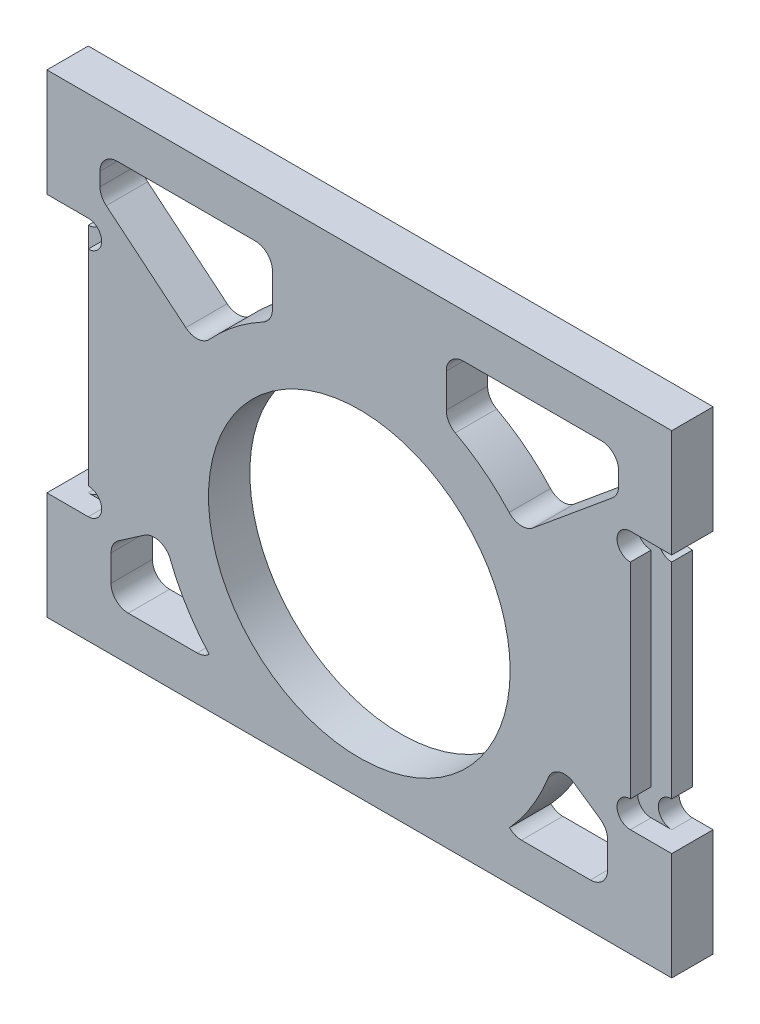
ISO-10303-21;
HEADER;
FILE_DESCRIPTION(('STEP AP214'),'2;1');
FILE_NAME('part.step','',(''),(''),'','','');
FILE_SCHEMA(('AUTOMOTIVE_DESIGN { 1 0 10303 214 1 1 1 1 }'));
ENDSEC;
DATA;
#1=APPLICATION_CONTEXT('core data for automotive mechanical design processes');
#2=APPLICATION_PROTOCOL_DEFINITION('international standard','automotive_design',2000,#1);
#3=PRODUCT_CONTEXT('',#1,'mechanical');
#4=PRODUCT('Part','Part','',(#3));
#5=PRODUCT_RELATED_PRODUCT_CATEGORY('part','',(#4));
#6=PRODUCT_DEFINITION_FORMATION('','',#4);
#7=PRODUCT_DEFINITION_CONTEXT('part definition',#1,'design');
#8=PRODUCT_DEFINITION('design','',#6,#7);
#9=PRODUCT_DEFINITION_SHAPE('','',#8);
#10=(LENGTH_UNIT() NAMED_UNIT(*) SI_UNIT(.MILLI.,.METRE.));
#11=(NAMED_UNIT(*) PLANE_ANGLE_UNIT() SI_UNIT($,.RADIAN.));
#12=(NAMED_UNIT(*) SI_UNIT($,.STERADIAN.) SOLID_ANGLE_UNIT());
#13=UNCERTAINTY_MEASURE_WITH_UNIT(LENGTH_MEASURE(1.E-05),#10,'distance_accuracy_value','');
#14=(GEOMETRIC_REPRESENTATION_CONTEXT(3) GLOBAL_UNCERTAINTY_ASSIGNED_CONTEXT((#13)) GLOBAL_UNIT_ASSIGNED_CONTEXT((#10,
#11,#12)) REPRESENTATION_CONTEXT('',''));
#15=CARTESIAN_POINT('',(0.,0.,0.));
#16=DIRECTION('',(0.,0.,1.));
#17=DIRECTION('',(1.,0.,0.));
#18=AXIS2_PLACEMENT_3D('',#15,#16,#17);
#19=CARTESIAN_POINT('',(0.,0.,4.8));
#20=DIRECTION('',(0.,0.,-1.));
#21=DIRECTION('',(0.,-1.,0.));
#22=AXIS2_PLACEMENT_3D('',#19,#20,#21);
#23=PLANE('',#22);
#24=CARTESIAN_POINT('',(-28.0868454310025,20.3994582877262,4.8));
#25=DIRECTION('',(0.,0.,-1.));
#26=DIRECTION('',(1.,0.,0.));
#27=AXIS2_PLACEMENT_3D('',#24,#25,#26);
#28=CIRCLE('',#27,2.);
#29=CARTESIAN_POINT('',(-30.0868454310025,20.3994582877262,4.8));
#30=VERTEX_POINT('',#29);
#31=CARTESIAN_POINT('',(-28.0868454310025,22.3994582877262,4.8));
#32=VERTEX_POINT('',#31);
#33=EDGE_CURVE('E595',#30,#32,#28,.T.);
#34=ORIENTED_EDGE('',*,*,#33,.T.);
#35=DIRECTION('',(1.,0.,0.));
#36=VECTOR('',#35,1.);
#37=CARTESIAN_POINT('',(-28.0868454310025,22.3994582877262,4.8));
#38=LINE('',#37,#36);
#39=CARTESIAN_POINT('',(-12.0868454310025,22.3994582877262,4.8));
#40=VERTEX_POINT('',#39);
#41=EDGE_CURVE('E745',#32,#40,#38,.T.);
#42=ORIENTED_EDGE('',*,*,#41,.T.);
#43=CARTESIAN_POINT('',(-12.0868454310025,20.3994582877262,4.8));
#44=DIRECTION('',(0.,0.,-1.));
#45=DIRECTION('',(-1.,0.,0.));
#46=AXIS2_PLACEMENT_3D('',#43,#44,#45);
#47=CIRCLE('',#46,2.);
#48=CARTESIAN_POINT('',(-10.0868454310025,20.3994582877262,4.8));
#49=VERTEX_POINT('',#48);
#50=EDGE_CURVE('E866',#40,#49,#47,.T.);
#51=ORIENTED_EDGE('',*,*,#50,.T.);
#52=DIRECTION('',(0.,-1.,0.));
#53=VECTOR('',#52,1.);
#54=CARTESIAN_POINT('',(-10.0868454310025,20.3994582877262,4.8));
#55=LINE('',#54,#53);
#56=CARTESIAN_POINT('',(-10.0868454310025,16.4840264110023,4.8));
#57=VERTEX_POINT('',#56);
#58=EDGE_CURVE('E981',#49,#57,#55,.T.);
#59=ORIENTED_EDGE('',*,*,#58,.T.);
#60=CARTESIAN_POINT('',(-12.0868454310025,16.4840264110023,4.8));
#61=DIRECTION('',(0.,0.,-1.));
#62=DIRECTION('',(-1.,0.,0.));
#63=AXIS2_PLACEMENT_3D('',#60,#61,#62);
#64=CIRCLE('',#63,2.);
#65=CARTESIAN_POINT('',(-11.1398531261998,14.7224346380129,4.8));
#66=VERTEX_POINT('',#65);
#67=EDGE_CURVE('E1072',#57,#66,#64,.T.);
#68=ORIENTED_EDGE('',*,*,#67,.T.);
#69=CARTESIAN_POINT('',(0.,-6.,4.8));
#70=DIRECTION('',(0.,0.,1.));
#71=DIRECTION('',(1.,0.,0.));
#72=AXIS2_PLACEMENT_3D('',#69,#70,#71);
#73=CIRCLE('',#72,23.5269127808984);
#74=CARTESIAN_POINT('',(-17.3814256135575,9.85565100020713,4.8));
#75=VERTEX_POINT('',#74);
#76=EDGE_CURVE('E575',#66,#75,#73,.T.);
#77=ORIENTED_EDGE('',*,*,#76,.T.);
#78=CARTESIAN_POINT('',(-18.8590037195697,11.2035244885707,4.8));
#79=DIRECTION('',(0.,0.,-1.));
#80=DIRECTION('',(-1.,0.,0.));
#81=AXIS2_PLACEMENT_3D('',#78,#79,#80);
#82=CIRCLE('',#81,2.);
#83=CARTESIAN_POINT('',(-20.1341391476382,9.66273584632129,4.8));
#84=VERTEX_POINT('',#83);
#85=EDGE_CURVE('E693',#75,#84,#82,.T.);
#86=ORIENTED_EDGE('',*,*,#85,.T.);
#87=DIRECTION('',(-0.77039432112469,0.637567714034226,0.));
#88=VECTOR('',#87,1.);
#89=CARTESIAN_POINT('',(-29.3619808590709,17.2995703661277,4.8));
#90=LINE('',#89,#88);
#91=CARTESIAN_POINT('',(-29.3619808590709,17.2995703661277,4.8));
#92=VERTEX_POINT('',#91);
#93=EDGE_CURVE('E611',#84,#92,#90,.T.);
#94=ORIENTED_EDGE('',*,*,#93,.T.);
#95=CARTESIAN_POINT('',(-28.0868454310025,18.840359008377,4.8));
#96=DIRECTION('',(0.,0.,-1.));
#97=DIRECTION('',(1.,0.,0.));
#98=AXIS2_PLACEMENT_3D('',#95,#96,#97);
#99=CIRCLE('',#98,2.);
#100=CARTESIAN_POINT('',(-30.0868454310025,18.840359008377,4.8));
#101=VERTEX_POINT('',#100);
#102=EDGE_CURVE('E1109',#92,#101,#99,.T.);
#103=ORIENTED_EDGE('',*,*,#102,.T.);
#104=DIRECTION('',(0.,1.,0.));
#105=VECTOR('',#104,1.);
#106=CARTESIAN_POINT('',(-30.0868454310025,20.3994582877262,4.8));
#107=LINE('',#106,#105);
#108=EDGE_CURVE('E800',#101,#30,#107,.T.);
#109=ORIENTED_EDGE('',*,*,#108,.T.);
#110=EDGE_LOOP('',(#34,#42,#51,#59,#68,#77,#86,#94,#103,#109));
#111=FACE_BOUND('',#110,.T.);
#112=DIRECTION('',(-1.,0.,0.));
#113=VECTOR('',#112,1.);
#114=CARTESIAN_POINT('',(33.85,15.,4.8));
#115=LINE('',#114,#113);
#116=CARTESIAN_POINT('',(36.25,15.,4.8));
#117=VERTEX_POINT('',#116);
#118=CARTESIAN_POINT('',(31.45,15.,4.8));
#119=VERTEX_POINT('',#118);
#120=EDGE_CURVE('E790',#117,#119,#115,.T.);
#121=ORIENTED_EDGE('',*,*,#120,.F.);
#122=DIRECTION('',(0.,-1.,0.));
#123=VECTOR('',#122,1.);
#124=CARTESIAN_POINT('',(36.25,27.5,4.8));
#125=LINE('',#124,#123);
#126=CARTESIAN_POINT('',(36.25,27.5,4.8));
#127=VERTEX_POINT('',#126);
#128=EDGE_CURVE('E27',#127,#117,#125,.T.);
#129=ORIENTED_EDGE('',*,*,#128,.F.);
#130=DIRECTION('',(1.,0.,0.));
#131=VECTOR('',#130,1.);
#132=CARTESIAN_POINT('',(-36.25,27.5,4.8));
#133=LINE('',#132,#131);
#134=CARTESIAN_POINT('',(-36.25,27.5,4.8));
#135=VERTEX_POINT('',#134);
#136=EDGE_CURVE('E1012',#135,#127,#133,.T.);
#137=ORIENTED_EDGE('',*,*,#136,.F.);
#138=DIRECTION('',(0.,1.,0.));
#139=VECTOR('',#138,1.);
#140=CARTESIAN_POINT('',(-36.25,-27.5,4.8));
#141=LINE('',#140,#139);
#142=CARTESIAN_POINT('',(-36.25,15.,4.8));
#143=VERTEX_POINT('',#142);
#144=EDGE_CURVE('E756',#143,#135,#141,.T.);
#145=ORIENTED_EDGE('',*,*,#144,.F.);
#146=DIRECTION('',(-1.,0.,0.));
#147=VECTOR('',#146,1.);
#148=CARTESIAN_POINT('',(-33.85,15.,4.8));
#149=LINE('',#148,#147);
#150=CARTESIAN_POINT('',(-31.45,15.,4.8));
#151=VERTEX_POINT('',#150);
#152=EDGE_CURVE('E831',#151,#143,#149,.T.);
#153=ORIENTED_EDGE('',*,*,#152,.F.);
#154=CARTESIAN_POINT('',(-31.45,13.45,4.8));
#155=DIRECTION('',(0.,0.,1.));
#156=DIRECTION('',(-1.,0.,0.));
#157=AXIS2_PLACEMENT_3D('',#154,#155,#156);
#158=CIRCLE('',#157,1.55);
#159=CARTESIAN_POINT('',(-31.45,11.9,4.8));
#160=VERTEX_POINT('',#159);
#161=EDGE_CURVE('E824',#160,#151,#158,.T.);
#162=ORIENTED_EDGE('',*,*,#161,.F.);
#163=DIRECTION('',(0.,1.,0.));
#164=VECTOR('',#163,1.);
#165=CARTESIAN_POINT('',(-31.45,-11.9,4.8));
#166=LINE('',#165,#164);
#167=CARTESIAN_POINT('',(-31.45,-11.9,4.8));
#168=VERTEX_POINT('',#167);
#169=EDGE_CURVE('E648',#168,#160,#166,.T.);
#170=ORIENTED_EDGE('',*,*,#169,.F.);
#171=CARTESIAN_POINT('',(-31.45,-13.45,4.8));
#172=DIRECTION('',(0.,0.,1.));
#173=DIRECTION('',(-1.,0.,0.));
#174=AXIS2_PLACEMENT_3D('',#171,#172,#173);
#175=CIRCLE('',#174,1.55);
#176=CARTESIAN_POINT('',(-31.45,-15.,4.8));
#177=VERTEX_POINT('',#176);
#178=EDGE_CURVE('E647',#177,#168,#175,.T.);
#179=ORIENTED_EDGE('',*,*,#178,.F.);
#180=DIRECTION('',(1.,0.,0.));
#181=VECTOR('',#180,1.);
#182=CARTESIAN_POINT('',(-33.85,-15.,4.8));
#183=LINE('',#182,#181);
#184=CARTESIAN_POINT('',(-36.25,-15.,4.8));
#185=VERTEX_POINT('',#184);
#186=EDGE_CURVE('E570',#185,#177,#183,.T.);
#187=ORIENTED_EDGE('',*,*,#186,.F.);
#188=DIRECTION('',(0.,1.,0.));
#189=VECTOR('',#188,1.);
#190=CARTESIAN_POINT('',(-36.25,-27.5,4.8));
#191=LINE('',#190,#189);
#192=CARTESIAN_POINT('',(-36.25,-27.5,4.8));
#193=VERTEX_POINT('',#192);
#194=EDGE_CURVE('E586',#193,#185,#191,.T.);
#195=ORIENTED_EDGE('',*,*,#194,.F.);
#196=DIRECTION('',(-1.,0.,0.));
#197=VECTOR('',#196,1.);
#198=CARTESIAN_POINT('',(36.25,-27.5,4.8));
#199=LINE('',#198,#197);
#200=CARTESIAN_POINT('',(36.25,-27.5,4.8));
#201=VERTEX_POINT('',#200);
#202=EDGE_CURVE('E620',#201,#193,#199,.T.);
#203=ORIENTED_EDGE('',*,*,#202,.F.);
#204=DIRECTION('',(0.,-1.,0.));
#205=VECTOR('',#204,1.);
#206=CARTESIAN_POINT('',(36.25,27.5,4.8));
#207=LINE('',#206,#205);
#208=CARTESIAN_POINT('',(36.25,-15.,4.8));
#209=VERTEX_POINT('',#208);
#210=EDGE_CURVE('E250',#209,#201,#207,.T.);
#211=ORIENTED_EDGE('',*,*,#210,.F.);
#212=DIRECTION('',(1.,0.,0.));
#213=VECTOR('',#212,1.);
#214=CARTESIAN_POINT('',(31.45,-15.,4.8));
#215=LINE('',#214,#213);
#216=CARTESIAN_POINT('',(31.45,-15.,4.8));
#217=VERTEX_POINT('',#216);
#218=EDGE_CURVE('E637',#217,#209,#215,.T.);
#219=ORIENTED_EDGE('',*,*,#218,.F.);
#220=CARTESIAN_POINT('',(31.45,-13.45,4.8));
#221=DIRECTION('',(0.,0.,1.));
#222=DIRECTION('',(1.,0.,0.));
#223=AXIS2_PLACEMENT_3D('',#220,#221,#222);
#224=CIRCLE('',#223,1.55);
#225=CARTESIAN_POINT('',(31.45,-11.9,4.8));
#226=VERTEX_POINT('',#225);
#227=EDGE_CURVE('E761',#226,#217,#224,.T.);
#228=ORIENTED_EDGE('',*,*,#227,.F.);
#229=DIRECTION('',(0.,-1.,0.));
#230=VECTOR('',#229,1.);
#231=CARTESIAN_POINT('',(31.45,11.9,4.8));
#232=LINE('',#231,#230);
#233=CARTESIAN_POINT('',(31.45,11.9,4.8));
#234=VERTEX_POINT('',#233);
#235=EDGE_CURVE('E675',#234,#226,#232,.T.);
#236=ORIENTED_EDGE('',*,*,#235,.F.);
#237=CARTESIAN_POINT('',(31.45,13.45,4.8));
#238=DIRECTION('',(0.,0.,1.));
#239=DIRECTION('',(1.,0.,0.));
#240=AXIS2_PLACEMENT_3D('',#237,#238,#239);
#241=CIRCLE('',#240,1.55);
#242=EDGE_CURVE('E966',#119,#234,#241,.T.);
#243=ORIENTED_EDGE('',*,*,#242,.F.);
#244=EDGE_LOOP('',(#121,#129,#137,#145,#153,#162,#170,#179,#187,#195,#203,#211,#219,#228,#236,#243));
#245=FACE_BOUND('',#244,.T.);
#246=CARTESIAN_POINT('',(0.,-6.,4.8));
#247=DIRECTION('',(0.,0.,-1.));
#248=DIRECTION('',(1.,0.,0.));
#249=AXIS2_PLACEMENT_3D('',#246,#247,#248);
#250=CIRCLE('',#249,17.5);
#251=CARTESIAN_POINT('',(17.5,-6.,4.8));
#252=VERTEX_POINT('',#251);
#253=EDGE_CURVE('E902',#252,#252,#250,.T.);
#254=ORIENTED_EDGE('',*,*,#253,.T.);
#255=EDGE_LOOP('',(#254));
#256=FACE_BOUND('',#255,.T.);
#257=CARTESIAN_POINT('',(28.0868454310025,18.840359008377,4.8));
#258=DIRECTION('',(0.,0.,-1.));
#259=DIRECTION('',(-1.,0.,0.));
#260=AXIS2_PLACEMENT_3D('',#257,#258,#259);
#261=CIRCLE('',#260,2.);
#262=CARTESIAN_POINT('',(30.0868454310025,18.840359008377,4.8));
#263=VERTEX_POINT('',#262);
#264=CARTESIAN_POINT('',(29.3619808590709,17.2995703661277,4.8));
#265=VERTEX_POINT('',#264);
#266=EDGE_CURVE('E915',#263,#265,#261,.T.);
#267=ORIENTED_EDGE('',*,*,#266,.T.);
#268=DIRECTION('',(-0.77039432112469,-0.637567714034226,0.));
#269=VECTOR('',#268,1.);
#270=CARTESIAN_POINT('',(29.3619808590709,17.2995703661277,4.8));
#271=LINE('',#270,#269);
#272=CARTESIAN_POINT('',(20.1341391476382,9.66273584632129,4.8));
#273=VERTEX_POINT('',#272);
#274=EDGE_CURVE('E1004',#265,#273,#271,.T.);
#275=ORIENTED_EDGE('',*,*,#274,.T.);
#276=CARTESIAN_POINT('',(18.8590037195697,11.2035244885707,4.8));
#277=DIRECTION('',(0.,0.,-1.));
#278=DIRECTION('',(-1.,0.,0.));
#279=AXIS2_PLACEMENT_3D('',#276,#277,#278);
#280=CIRCLE('',#279,2.);
#281=CARTESIAN_POINT('',(17.3814256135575,9.85565100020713,4.8));
#282=VERTEX_POINT('',#281);
#283=EDGE_CURVE('E689',#273,#282,#280,.T.);
#284=ORIENTED_EDGE('',*,*,#283,.T.);
#285=CARTESIAN_POINT('',(0.,-6.,4.8));
#286=DIRECTION('',(0.,0.,1.));
#287=DIRECTION('',(1.,0.,0.));
#288=AXIS2_PLACEMENT_3D('',#285,#286,#287);
#289=CIRCLE('',#288,23.5269127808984);
#290=CARTESIAN_POINT('',(11.1398531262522,14.7224346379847,4.8));
#291=VERTEX_POINT('',#290);
#292=EDGE_CURVE('E685',#282,#291,#289,.T.);
#293=ORIENTED_EDGE('',*,*,#292,.T.);
#294=CARTESIAN_POINT('',(12.0868454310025,16.4840264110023,4.8));
#295=DIRECTION('',(0.,0.,-1.));
#296=DIRECTION('',(-1.,0.,0.));
#297=AXIS2_PLACEMENT_3D('',#294,#295,#296);
#298=CIRCLE('',#297,2.);
#299=CARTESIAN_POINT('',(10.0868454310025,16.4840264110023,4.8));
#300=VERTEX_POINT('',#299);
#301=EDGE_CURVE('E665',#291,#300,#298,.T.);
#302=ORIENTED_EDGE('',*,*,#301,.T.);
#303=DIRECTION('',(0.,1.,0.));
#304=VECTOR('',#303,1.);
#305=CARTESIAN_POINT('',(10.0868454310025,20.3994582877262,4.8));
#306=LINE('',#305,#304);
#307=CARTESIAN_POINT('',(10.0868454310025,20.3994582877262,4.8));
#308=VERTEX_POINT('',#307);
#309=EDGE_CURVE('E796',#300,#308,#306,.T.);
#310=ORIENTED_EDGE('',*,*,#309,.T.);
#311=CARTESIAN_POINT('',(12.0868454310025,20.3994582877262,4.8));
#312=DIRECTION('',(0.,0.,-1.));
#313=DIRECTION('',(1.,0.,0.));
#314=AXIS2_PLACEMENT_3D('',#311,#312,#313);
#315=CIRCLE('',#314,2.);
#316=CARTESIAN_POINT('',(12.0868454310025,22.3994582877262,4.8));
#317=VERTEX_POINT('',#316);
#318=EDGE_CURVE('E659',#308,#317,#315,.T.);
#319=ORIENTED_EDGE('',*,*,#318,.T.);
#320=DIRECTION('',(1.,0.,0.));
#321=VECTOR('',#320,1.);
#322=CARTESIAN_POINT('',(28.0868454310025,22.3994582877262,4.8));
#323=LINE('',#322,#321);
#324=CARTESIAN_POINT('',(28.0868454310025,22.3994582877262,4.8));
#325=VERTEX_POINT('',#324);
#326=EDGE_CURVE('E788',#317,#325,#323,.T.);
#327=ORIENTED_EDGE('',*,*,#326,.T.);
#328=CARTESIAN_POINT('',(28.0868454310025,20.3994582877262,4.8));
#329=DIRECTION('',(0.,0.,-1.));
#330=DIRECTION('',(-1.,0.,0.));
#331=AXIS2_PLACEMENT_3D('',#328,#329,#330);
#332=CIRCLE('',#331,2.);
#333=CARTESIAN_POINT('',(30.0868454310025,20.3994582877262,4.8));
#334=VERTEX_POINT('',#333);
#335=EDGE_CURVE('E1024',#325,#334,#332,.T.);
#336=ORIENTED_EDGE('',*,*,#335,.T.);
#337=DIRECTION('',(0.,-1.,0.));
#338=VECTOR('',#337,1.);
#339=CARTESIAN_POINT('',(30.0868454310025,20.3994582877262,4.8));
#340=LINE('',#339,#338);
#341=EDGE_CURVE('E744',#334,#263,#340,.T.);
#342=ORIENTED_EDGE('',*,*,#341,.T.);
#343=EDGE_LOOP('',(#267,#275,#284,#293,#302,#310,#319,#327,#336,#342));
#344=FACE_BOUND('',#343,.T.);
#345=CARTESIAN_POINT('',(18.8124475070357,-20.3706534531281,4.8));
#346=DIRECTION('',(0.,0.,-1.));
#347=DIRECTION('',(1.,0.,0.));
#348=AXIS2_PLACEMENT_3D('',#345,#346,#347);
#349=CIRCLE('',#348,2.);
#350=CARTESIAN_POINT('',(18.8124475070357,-22.3706534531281,4.8));
#351=VERTEX_POINT('',#350);
#352=CARTESIAN_POINT('',(17.4233621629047,-21.809556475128,4.8));
#353=VERTEX_POINT('',#352);
#354=EDGE_CURVE('E679',#351,#353,#349,.T.);
#355=ORIENTED_EDGE('',*,*,#354,.T.);
#356=CARTESIAN_POINT('',(0.,-6.,4.8));
#357=DIRECTION('',(0.,0.,1.));
#358=DIRECTION('',(1.,0.,0.));
#359=AXIS2_PLACEMENT_3D('',#356,#357,#358);
#360=CIRCLE('',#359,23.5269127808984);
#361=CARTESIAN_POINT('',(21.9329661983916,-14.5123803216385,4.8));
#362=VERTEX_POINT('',#361);
#363=EDGE_CURVE('E660',#353,#362,#360,.T.);
#364=ORIENTED_EDGE('',*,*,#363,.T.);
#365=CARTESIAN_POINT('',(23.797465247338,-15.2360123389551,4.8));
#366=DIRECTION('',(0.,0.,-1.));
#367=DIRECTION('',(-1.,0.,0.));
#368=AXIS2_PLACEMENT_3D('',#365,#366,#367);
#369=CIRCLE('',#368,2.);
#370=CARTESIAN_POINT('',(24.9329311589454,-13.5895867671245,4.8));
#371=VERTEX_POINT('',#370);
#372=EDGE_CURVE('E578',#362,#371,#369,.T.);
#373=ORIENTED_EDGE('',*,*,#372,.T.);
#374=DIRECTION('',(0.823212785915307,-0.567732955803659,0.));
#375=VECTOR('',#374,1.);
#376=CARTESIAN_POINT('',(27.947913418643,-15.6688848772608,4.8));
#377=LINE('',#376,#375);
#378=CARTESIAN_POINT('',(27.947913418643,-15.6688848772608,4.8));
#379=VERTEX_POINT('',#378);
#380=EDGE_CURVE('E735',#371,#379,#377,.T.);
#381=ORIENTED_EDGE('',*,*,#380,.T.);
#382=CARTESIAN_POINT('',(26.8124475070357,-17.3153104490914,4.8));
#383=DIRECTION('',(0.,0.,-1.));
#384=DIRECTION('',(-1.,0.,0.));
#385=AXIS2_PLACEMENT_3D('',#382,#383,#384);
#386=CIRCLE('',#385,2.);
#387=CARTESIAN_POINT('',(28.8124475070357,-17.3153104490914,4.8));
#388=VERTEX_POINT('',#387);
#389=EDGE_CURVE('E625',#379,#388,#386,.T.);
#390=ORIENTED_EDGE('',*,*,#389,.T.);
#391=DIRECTION('',(0.,-1.,0.));
#392=VECTOR('',#391,1.);
#393=CARTESIAN_POINT('',(28.8124475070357,-20.3706534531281,4.8));
#394=LINE('',#393,#392);
#395=CARTESIAN_POINT('',(28.8124475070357,-20.3706534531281,4.8));
#396=VERTEX_POINT('',#395);
#397=EDGE_CURVE('E697',#388,#396,#394,.T.);
#398=ORIENTED_EDGE('',*,*,#397,.T.);
#399=CARTESIAN_POINT('',(26.8124475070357,-20.3706534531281,4.8));
#400=DIRECTION('',(0.,0.,-1.));
#401=DIRECTION('',(-1.,0.,0.));
#402=AXIS2_PLACEMENT_3D('',#399,#400,#401);
#403=CIRCLE('',#402,2.);
#404=CARTESIAN_POINT('',(26.8124475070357,-22.3706534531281,4.8));
#405=VERTEX_POINT('',#404);
#406=EDGE_CURVE('E839',#396,#405,#403,.T.);
#407=ORIENTED_EDGE('',*,*,#406,.T.);
#408=DIRECTION('',(-1.,0.,0.));
#409=VECTOR('',#408,1.);
#410=CARTESIAN_POINT('',(26.8124475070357,-22.3706534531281,4.8));
#411=LINE('',#410,#409);
#412=EDGE_CURVE('E603',#405,#351,#411,.T.);
#413=ORIENTED_EDGE('',*,*,#412,.T.);
#414=EDGE_LOOP('',(#355,#364,#373,#381,#390,#398,#407,#413));
#415=FACE_BOUND('',#414,.T.);
#416=CARTESIAN_POINT('',(0.,-6.,4.8));
#417=DIRECTION('',(0.,0.,1.));
#418=DIRECTION('',(1.,0.,0.));
#419=AXIS2_PLACEMENT_3D('',#416,#417,#418);
#420=CIRCLE('',#419,23.5269127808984);
#421=CARTESIAN_POINT('',(-21.9329661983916,-14.5123803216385,4.8));
#422=VERTEX_POINT('',#421);
#423=CARTESIAN_POINT('',(-17.4233621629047,-21.809556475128,4.8));
#424=VERTEX_POINT('',#423);
#425=EDGE_CURVE('E709',#422,#424,#420,.T.);
#426=ORIENTED_EDGE('',*,*,#425,.T.);
#427=CARTESIAN_POINT('',(-18.8124475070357,-20.3706534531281,4.8));
#428=DIRECTION('',(0.,0.,-1.));
#429=DIRECTION('',(1.,0.,0.));
#430=AXIS2_PLACEMENT_3D('',#427,#428,#429);
#431=CIRCLE('',#430,2.);
#432=CARTESIAN_POINT('',(-18.8124475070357,-22.3706534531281,4.8));
#433=VERTEX_POINT('',#432);
#434=EDGE_CURVE('E884',#424,#433,#431,.T.);
#435=ORIENTED_EDGE('',*,*,#434,.T.);
#436=DIRECTION('',(-1.,0.,0.));
#437=VECTOR('',#436,1.);
#438=CARTESIAN_POINT('',(-26.8124475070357,-22.3706534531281,4.8));
#439=LINE('',#438,#437);
#440=CARTESIAN_POINT('',(-26.8124475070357,-22.3706534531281,4.8));
#441=VERTEX_POINT('',#440);
#442=EDGE_CURVE('E527',#433,#441,#439,.T.);
#443=ORIENTED_EDGE('',*,*,#442,.T.);
#444=CARTESIAN_POINT('',(-26.8124475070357,-20.3706534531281,4.8));
#445=DIRECTION('',(0.,0.,-1.));
#446=DIRECTION('',(1.,0.,0.));
#447=AXIS2_PLACEMENT_3D('',#444,#445,#446);
#448=CIRCLE('',#447,2.);
#449=CARTESIAN_POINT('',(-28.8124475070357,-20.3706534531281,4.8));
#450=VERTEX_POINT('',#449);
#451=EDGE_CURVE('E520',#441,#450,#448,.T.);
#452=ORIENTED_EDGE('',*,*,#451,.T.);
#453=DIRECTION('',(0.,1.,0.));
#454=VECTOR('',#453,1.);
#455=CARTESIAN_POINT('',(-28.8124475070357,-20.3706534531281,4.8));
#456=LINE('',#455,#454);
#457=CARTESIAN_POINT('',(-28.8124475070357,-17.3153104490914,4.8));
#458=VERTEX_POINT('',#457);
#459=EDGE_CURVE('E524',#450,#458,#456,.T.);
#460=ORIENTED_EDGE('',*,*,#459,.T.);
#461=CARTESIAN_POINT('',(-26.8124475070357,-17.3153104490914,4.8));
#462=DIRECTION('',(0.,0.,-1.));
#463=DIRECTION('',(1.,0.,0.));
#464=AXIS2_PLACEMENT_3D('',#461,#462,#463);
#465=CIRCLE('',#464,2.);
#466=CARTESIAN_POINT('',(-27.947913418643,-15.6688848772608,4.8));
#467=VERTEX_POINT('',#466);
#468=EDGE_CURVE('E778',#458,#467,#465,.T.);
#469=ORIENTED_EDGE('',*,*,#468,.T.);
#470=DIRECTION('',(0.823212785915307,0.567732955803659,0.));
#471=VECTOR('',#470,1.);
#472=CARTESIAN_POINT('',(-27.947913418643,-15.6688848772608,4.8));
#473=LINE('',#472,#471);
#474=CARTESIAN_POINT('',(-24.9329311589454,-13.5895867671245,4.8));
#475=VERTEX_POINT('',#474);
#476=EDGE_CURVE('E767',#467,#475,#473,.T.);
#477=ORIENTED_EDGE('',*,*,#476,.T.);
#478=CARTESIAN_POINT('',(-23.797465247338,-15.2360123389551,4.8));
#479=DIRECTION('',(0.,0.,-1.));
#480=DIRECTION('',(-1.,0.,0.));
#481=AXIS2_PLACEMENT_3D('',#478,#479,#480);
#482=CIRCLE('',#481,2.);
#483=EDGE_CURVE('E861',#475,#422,#482,.T.);
#484=ORIENTED_EDGE('',*,*,#483,.T.);
#485=EDGE_LOOP('',(#426,#435,#443,#452,#460,#469,#477,#484));
#486=FACE_BOUND('',#485,.T.);
#487=ADVANCED_FACE('F16',(#111,#245,#256,#344,#415,#486),#23,.F.);
#488=CARTESIAN_POINT('',(0.,0.,0.));
#489=DIRECTION('',(0.,0.,-1.));
#490=DIRECTION('',(0.,-1.,0.));
#491=AXIS2_PLACEMENT_3D('',#488,#489,#490);
#492=PLANE('',#491);
#493=DIRECTION('',(0.,-1.,0.));
#494=VECTOR('',#493,1.);
#495=CARTESIAN_POINT('',(36.25,27.5,0.));
#496=LINE('',#495,#494);
#497=CARTESIAN_POINT('',(36.25,27.5,0.));
#498=VERTEX_POINT('',#497);
#499=CARTESIAN_POINT('',(36.25,15.,0.));
#500=VERTEX_POINT('',#499);
#501=EDGE_CURVE('E10',#498,#500,#496,.T.);
#502=ORIENTED_EDGE('',*,*,#501,.T.);
#503=DIRECTION('',(1.,0.,0.));
#504=VECTOR('',#503,1.);
#505=CARTESIAN_POINT('',(36.25,15.,0.));
#506=LINE('',#505,#504);
#507=CARTESIAN_POINT('',(33.85,15.,0.));
#508=VERTEX_POINT('',#507);
#509=EDGE_CURVE('E794',#508,#500,#506,.T.);
#510=ORIENTED_EDGE('',*,*,#509,.F.);
#511=CARTESIAN_POINT('',(33.85,13.45,0.));
#512=DIRECTION('',(0.,0.,-1.));
#513=DIRECTION('',(1.,0.,0.));
#514=AXIS2_PLACEMENT_3D('',#511,#512,#513);
#515=CIRCLE('',#514,1.55);
#516=CARTESIAN_POINT('',(33.85,11.9,0.));
#517=VERTEX_POINT('',#516);
#518=EDGE_CURVE('E849',#517,#508,#515,.T.);
#519=ORIENTED_EDGE('',*,*,#518,.F.);
#520=DIRECTION('',(0.,1.,0.));
#521=VECTOR('',#520,1.);
#522=CARTESIAN_POINT('',(33.85,11.9,0.));
#523=LINE('',#522,#521);
#524=CARTESIAN_POINT('',(33.85,-11.9,0.));
#525=VERTEX_POINT('',#524);
#526=EDGE_CURVE('E926',#525,#517,#523,.T.);
#527=ORIENTED_EDGE('',*,*,#526,.F.);
#528=CARTESIAN_POINT('',(33.85,-13.45,0.));
#529=DIRECTION('',(0.,0.,-1.));
#530=DIRECTION('',(1.,0.,0.));
#531=AXIS2_PLACEMENT_3D('',#528,#529,#530);
#532=CIRCLE('',#531,1.55);
#533=CARTESIAN_POINT('',(33.85,-15.,0.));
#534=VERTEX_POINT('',#533);
#535=EDGE_CURVE('E563',#534,#525,#532,.T.);
#536=ORIENTED_EDGE('',*,*,#535,.F.);
#537=DIRECTION('',(-1.,0.,0.));
#538=VECTOR('',#537,1.);
#539=CARTESIAN_POINT('',(33.85,-15.,0.));
#540=LINE('',#539,#538);
#541=CARTESIAN_POINT('',(36.25,-15.,0.));
#542=VERTEX_POINT('',#541);
#543=EDGE_CURVE('E403',#542,#534,#540,.T.);
#544=ORIENTED_EDGE('',*,*,#543,.F.);
#545=DIRECTION('',(0.,-1.,0.));
#546=VECTOR('',#545,1.);
#547=CARTESIAN_POINT('',(36.25,27.5,0.));
#548=LINE('',#547,#546);
#549=CARTESIAN_POINT('',(36.25,-27.5,0.));
#550=VERTEX_POINT('',#549);
#551=EDGE_CURVE('E598',#542,#550,#548,.T.);
#552=ORIENTED_EDGE('',*,*,#551,.T.);
#553=DIRECTION('',(-1.,0.,0.));
#554=VECTOR('',#553,1.);
#555=CARTESIAN_POINT('',(36.25,-27.5,0.));
#556=LINE('',#555,#554);
#557=CARTESIAN_POINT('',(-36.25,-27.5,0.));
#558=VERTEX_POINT('',#557);
#559=EDGE_CURVE('E911',#550,#558,#556,.T.);
#560=ORIENTED_EDGE('',*,*,#559,.T.);
#561=DIRECTION('',(0.,1.,0.));
#562=VECTOR('',#561,1.);
#563=CARTESIAN_POINT('',(-36.25,-27.5,0.));
#564=LINE('',#563,#562);
#565=CARTESIAN_POINT('',(-36.25,-15.,0.));
#566=VERTEX_POINT('',#565);
#567=EDGE_CURVE('E261',#558,#566,#564,.T.);
#568=ORIENTED_EDGE('',*,*,#567,.T.);
#569=DIRECTION('',(-1.,0.,0.));
#570=VECTOR('',#569,1.);
#571=CARTESIAN_POINT('',(-36.25,-15.,0.));
#572=LINE('',#571,#570);
#573=CARTESIAN_POINT('',(-33.85,-15.,0.));
#574=VERTEX_POINT('',#573);
#575=EDGE_CURVE('E565',#574,#566,#572,.T.);
#576=ORIENTED_EDGE('',*,*,#575,.F.);
#577=CARTESIAN_POINT('',(-33.85,-13.45,0.));
#578=DIRECTION('',(0.,0.,-1.));
#579=DIRECTION('',(-1.,0.,0.));
#580=AXIS2_PLACEMENT_3D('',#577,#578,#579);
#581=CIRCLE('',#580,1.55);
#582=CARTESIAN_POINT('',(-33.85,-11.9,0.));
#583=VERTEX_POINT('',#582);
#584=EDGE_CURVE('E753',#583,#574,#581,.T.);
#585=ORIENTED_EDGE('',*,*,#584,.F.);
#586=DIRECTION('',(0.,-1.,0.));
#587=VECTOR('',#586,1.);
#588=CARTESIAN_POINT('',(-33.85,11.9,0.));
#589=LINE('',#588,#587);
#590=CARTESIAN_POINT('',(-33.85,11.9,0.));
#591=VERTEX_POINT('',#590);
#592=EDGE_CURVE('E599',#591,#583,#589,.T.);
#593=ORIENTED_EDGE('',*,*,#592,.F.);
#594=CARTESIAN_POINT('',(-33.85,13.45,0.));
#595=DIRECTION('',(0.,0.,-1.));
#596=DIRECTION('',(-1.,0.,0.));
#597=AXIS2_PLACEMENT_3D('',#594,#595,#596);
#598=CIRCLE('',#597,1.55);
#599=CARTESIAN_POINT('',(-33.85,15.,0.));
#600=VERTEX_POINT('',#599);
#601=EDGE_CURVE('E636',#600,#591,#598,.T.);
#602=ORIENTED_EDGE('',*,*,#601,.F.);
#603=DIRECTION('',(1.,0.,0.));
#604=VECTOR('',#603,1.);
#605=CARTESIAN_POINT('',(-36.25,15.,0.));
#606=LINE('',#605,#604);
#607=CARTESIAN_POINT('',(-36.25,15.,0.));
#608=VERTEX_POINT('',#607);
#609=EDGE_CURVE('E714',#608,#600,#606,.T.);
#610=ORIENTED_EDGE('',*,*,#609,.F.);
#611=DIRECTION('',(0.,1.,0.));
#612=VECTOR('',#611,1.);
#613=CARTESIAN_POINT('',(-36.25,-27.5,0.));
#614=LINE('',#613,#612);
#615=CARTESIAN_POINT('',(-36.25,27.5,0.));
#616=VERTEX_POINT('',#615);
#617=EDGE_CURVE('E585',#608,#616,#614,.T.);
#618=ORIENTED_EDGE('',*,*,#617,.T.);
#619=DIRECTION('',(1.,0.,0.));
#620=VECTOR('',#619,1.);
#621=CARTESIAN_POINT('',(-36.25,27.5,0.));
#622=LINE('',#621,#620);
#623=EDGE_CURVE('E905',#616,#498,#622,.T.);
#624=ORIENTED_EDGE('',*,*,#623,.T.);
#625=EDGE_LOOP('',(#502,#510,#519,#527,#536,#544,#552,#560,#568,#576,#585,#593,#602,#610,#618,#624));
#626=FACE_BOUND('',#625,.T.);
#627=CARTESIAN_POINT('',(0.,-6.,0.));
#628=DIRECTION('',(0.,0.,-1.));
#629=DIRECTION('',(1.,0.,0.));
#630=AXIS2_PLACEMENT_3D('',#627,#628,#629);
#631=CIRCLE('',#630,17.5);
#632=CARTESIAN_POINT('',(17.5,-6.,0.));
#633=VERTEX_POINT('',#632);
#634=EDGE_CURVE('E619',#633,#633,#631,.T.);
#635=ORIENTED_EDGE('',*,*,#634,.F.);
#636=EDGE_LOOP('',(#635));
#637=FACE_BOUND('',#636,.T.);
#638=DIRECTION('',(-1.,0.,0.));
#639=VECTOR('',#638,1.);
#640=CARTESIAN_POINT('',(0.,22.3994582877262,0.));
#641=LINE('',#640,#639);
#642=CARTESIAN_POINT('',(-12.0868454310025,22.3994582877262,0.));
#643=VERTEX_POINT('',#642);
#644=CARTESIAN_POINT('',(-28.0868454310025,22.3994582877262,0.));
#645=VERTEX_POINT('',#644);
#646=EDGE_CURVE('E825',#643,#645,#641,.T.);
#647=ORIENTED_EDGE('',*,*,#646,.T.);
#648=CARTESIAN_POINT('',(-28.0868454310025,20.3994582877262,0.));
#649=DIRECTION('',(0.,0.,-1.));
#650=DIRECTION('',(-1.,0.,0.));
#651=AXIS2_PLACEMENT_3D('',#648,#649,#650);
#652=CIRCLE('',#651,2.);
#653=CARTESIAN_POINT('',(-30.0868454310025,20.3994582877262,0.));
#654=VERTEX_POINT('',#653);
#655=EDGE_CURVE('E564',#654,#645,#652,.T.);
#656=ORIENTED_EDGE('',*,*,#655,.F.);
#657=DIRECTION('',(0.,-1.,0.));
#658=VECTOR('',#657,1.);
#659=CARTESIAN_POINT('',(-30.0868454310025,0.,0.));
#660=LINE('',#659,#658);
#661=CARTESIAN_POINT('',(-30.0868454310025,18.840359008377,0.));
#662=VERTEX_POINT('',#661);
#663=EDGE_CURVE('E1050',#654,#662,#660,.T.);
#664=ORIENTED_EDGE('',*,*,#663,.T.);
#665=CARTESIAN_POINT('',(-28.0868454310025,18.840359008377,0.));
#666=DIRECTION('',(0.,0.,-1.));
#667=DIRECTION('',(-1.,0.,0.));
#668=AXIS2_PLACEMENT_3D('',#665,#666,#667);
#669=CIRCLE('',#668,2.);
#670=CARTESIAN_POINT('',(-29.3619808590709,17.2995703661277,0.));
#671=VERTEX_POINT('',#670);
#672=EDGE_CURVE('E615',#671,#662,#669,.T.);
#673=ORIENTED_EDGE('',*,*,#672,.F.);
#674=DIRECTION('',(0.77039432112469,-0.637567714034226,0.));
#675=VECTOR('',#674,1.);
#676=CARTESIAN_POINT('',(-3.43824982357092,-4.1545518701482,0.));
#677=LINE('',#676,#675);
#678=CARTESIAN_POINT('',(-20.1341391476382,9.66273584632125,0.));
#679=VERTEX_POINT('',#678);
#680=EDGE_CURVE('E820',#671,#679,#677,.T.);
#681=ORIENTED_EDGE('',*,*,#680,.T.);
#682=CARTESIAN_POINT('',(-18.8590037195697,11.2035244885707,0.));
#683=DIRECTION('',(0.,0.,-1.));
#684=DIRECTION('',(-1.,0.,0.));
#685=AXIS2_PLACEMENT_3D('',#682,#683,#684);
#686=CIRCLE('',#685,2.);
#687=CARTESIAN_POINT('',(-17.3814256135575,9.85565100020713,0.));
#688=VERTEX_POINT('',#687);
#689=EDGE_CURVE('E573',#688,#679,#686,.T.);
#690=ORIENTED_EDGE('',*,*,#689,.F.);
#691=CARTESIAN_POINT('',(0.,-6.,0.));
#692=DIRECTION('',(0.,0.,-1.));
#693=DIRECTION('',(-1.,0.,0.));
#694=AXIS2_PLACEMENT_3D('',#691,#692,#693);
#695=CIRCLE('',#694,23.5269127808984);
#696=CARTESIAN_POINT('',(-11.1398531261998,14.7224346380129,0.));
#697=VERTEX_POINT('',#696);
#698=EDGE_CURVE('E1042',#688,#697,#695,.T.);
#699=ORIENTED_EDGE('',*,*,#698,.T.);
#700=CARTESIAN_POINT('',(-12.0868454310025,16.4840264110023,0.));
#701=DIRECTION('',(0.,0.,-1.));
#702=DIRECTION('',(-1.,0.,0.));
#703=AXIS2_PLACEMENT_3D('',#700,#701,#702);
#704=CIRCLE('',#703,2.);
#705=CARTESIAN_POINT('',(-10.0868454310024,16.4840264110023,0.));
#706=VERTEX_POINT('',#705);
#707=EDGE_CURVE('E1086',#706,#697,#704,.T.);
#708=ORIENTED_EDGE('',*,*,#707,.F.);
#709=DIRECTION('',(0.,1.,0.));
#710=VECTOR('',#709,1.);
#711=CARTESIAN_POINT('',(-10.0868454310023,0.,0.));
#712=LINE('',#711,#710);
#713=CARTESIAN_POINT('',(-10.0868454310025,20.3994582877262,0.));
#714=VERTEX_POINT('',#713);
#715=EDGE_CURVE('E862',#706,#714,#712,.T.);
#716=ORIENTED_EDGE('',*,*,#715,.T.);
#717=CARTESIAN_POINT('',(-12.0868454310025,20.3994582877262,0.));
#718=DIRECTION('',(0.,0.,-1.));
#719=DIRECTION('',(-1.,0.,0.));
#720=AXIS2_PLACEMENT_3D('',#717,#718,#719);
#721=CIRCLE('',#720,2.);
#722=EDGE_CURVE('E749',#643,#714,#721,.T.);
#723=ORIENTED_EDGE('',*,*,#722,.F.);
#724=EDGE_LOOP('',(#647,#656,#664,#673,#681,#690,#699,#708,#716,#723));
#725=FACE_BOUND('',#724,.T.);
#726=DIRECTION('',(0.77039432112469,0.637567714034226,0.));
#727=VECTOR('',#726,1.);
#728=CARTESIAN_POINT('',(3.43824982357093,-4.15455187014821,0.));
#729=LINE('',#728,#727);
#730=CARTESIAN_POINT('',(20.1341391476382,9.66273584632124,0.));
#731=VERTEX_POINT('',#730);
#732=CARTESIAN_POINT('',(29.3619808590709,17.2995703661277,0.));
#733=VERTEX_POINT('',#732);
#734=EDGE_CURVE('E918',#731,#733,#729,.T.);
#735=ORIENTED_EDGE('',*,*,#734,.T.);
#736=CARTESIAN_POINT('',(28.0868454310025,18.840359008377,0.));
#737=DIRECTION('',(0.,0.,-1.));
#738=DIRECTION('',(-1.,0.,0.));
#739=AXIS2_PLACEMENT_3D('',#736,#737,#738);
#740=CIRCLE('',#739,2.);
#741=CARTESIAN_POINT('',(30.0868454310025,18.840359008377,0.));
#742=VERTEX_POINT('',#741);
#743=EDGE_CURVE('E558',#742,#733,#740,.T.);
#744=ORIENTED_EDGE('',*,*,#743,.F.);
#745=DIRECTION('',(0.,1.,0.));
#746=VECTOR('',#745,1.);
#747=CARTESIAN_POINT('',(30.0868454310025,0.,0.));
#748=LINE('',#747,#746);
#749=CARTESIAN_POINT('',(30.0868454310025,20.3994582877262,0.));
#750=VERTEX_POINT('',#749);
#751=EDGE_CURVE('E743',#742,#750,#748,.T.);
#752=ORIENTED_EDGE('',*,*,#751,.T.);
#753=CARTESIAN_POINT('',(28.0868454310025,20.3994582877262,0.));
#754=DIRECTION('',(0.,0.,-1.));
#755=DIRECTION('',(-1.,0.,0.));
#756=AXIS2_PLACEMENT_3D('',#753,#754,#755);
#757=CIRCLE('',#756,2.);
#758=CARTESIAN_POINT('',(28.0868454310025,22.3994582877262,0.));
#759=VERTEX_POINT('',#758);
#760=EDGE_CURVE('E784',#759,#750,#757,.T.);
#761=ORIENTED_EDGE('',*,*,#760,.F.);
#762=DIRECTION('',(-1.,0.,0.));
#763=VECTOR('',#762,1.);
#764=CARTESIAN_POINT('',(0.,22.3994582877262,0.));
#765=LINE('',#764,#763);
#766=CARTESIAN_POINT('',(12.0868454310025,22.3994582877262,0.));
#767=VERTEX_POINT('',#766);
#768=EDGE_CURVE('E991',#759,#767,#765,.T.);
#769=ORIENTED_EDGE('',*,*,#768,.T.);
#770=CARTESIAN_POINT('',(12.0868454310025,20.3994582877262,0.));
#771=DIRECTION('',(0.,0.,-1.));
#772=DIRECTION('',(-1.,0.,0.));
#773=AXIS2_PLACEMENT_3D('',#770,#771,#772);
#774=CIRCLE('',#773,2.);
#775=CARTESIAN_POINT('',(10.0868454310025,20.3994582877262,0.));
#776=VERTEX_POINT('',#775);
#777=EDGE_CURVE('E658',#776,#767,#774,.T.);
#778=ORIENTED_EDGE('',*,*,#777,.F.);
#779=DIRECTION('',(0.,-1.,0.));
#780=VECTOR('',#779,1.);
#781=CARTESIAN_POINT('',(10.0868454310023,0.,0.));
#782=LINE('',#781,#780);
#783=CARTESIAN_POINT('',(10.0868454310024,16.4840264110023,0.));
#784=VERTEX_POINT('',#783);
#785=EDGE_CURVE('E669',#776,#784,#782,.T.);
#786=ORIENTED_EDGE('',*,*,#785,.T.);
#787=CARTESIAN_POINT('',(12.0868454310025,16.4840264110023,0.));
#788=DIRECTION('',(0.,0.,-1.));
#789=DIRECTION('',(-1.,0.,0.));
#790=AXIS2_PLACEMENT_3D('',#787,#788,#789);
#791=CIRCLE('',#790,2.);
#792=CARTESIAN_POINT('',(11.1398531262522,14.7224346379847,0.));
#793=VERTEX_POINT('',#792);
#794=EDGE_CURVE('E843',#793,#784,#791,.T.);
#795=ORIENTED_EDGE('',*,*,#794,.F.);
#796=CARTESIAN_POINT('',(0.,-6.,0.));
#797=DIRECTION('',(0.,0.,-1.));
#798=DIRECTION('',(-1.,0.,0.));
#799=AXIS2_PLACEMENT_3D('',#796,#797,#798);
#800=CIRCLE('',#799,23.5269127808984);
#801=CARTESIAN_POINT('',(17.3814256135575,9.85565100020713,0.));
#802=VERTEX_POINT('',#801);
#803=EDGE_CURVE('E684',#793,#802,#800,.T.);
#804=ORIENTED_EDGE('',*,*,#803,.T.);
#805=CARTESIAN_POINT('',(18.8590037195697,11.2035244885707,0.));
#806=DIRECTION('',(0.,0.,-1.));
#807=DIRECTION('',(-1.,0.,0.));
#808=AXIS2_PLACEMENT_3D('',#805,#806,#807);
#809=CIRCLE('',#808,2.);
#810=EDGE_CURVE('E1015',#731,#802,#809,.T.);
#811=ORIENTED_EDGE('',*,*,#810,.F.);
#812=EDGE_LOOP('',(#735,#744,#752,#761,#769,#778,#786,#795,#804,#811));
#813=FACE_BOUND('',#812,.T.);
#814=CARTESIAN_POINT('',(0.,-6.,0.));
#815=DIRECTION('',(0.,0.,-1.));
#816=DIRECTION('',(-1.,0.,0.));
#817=AXIS2_PLACEMENT_3D('',#814,#815,#816);
#818=CIRCLE('',#817,23.5269127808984);
#819=CARTESIAN_POINT('',(21.9329661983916,-14.5123803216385,0.));
#820=VERTEX_POINT('',#819);
#821=CARTESIAN_POINT('',(17.4233621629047,-21.809556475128,0.));
#822=VERTEX_POINT('',#821);
#823=EDGE_CURVE('E664',#820,#822,#818,.T.);
#824=ORIENTED_EDGE('',*,*,#823,.T.);
#825=CARTESIAN_POINT('',(18.8124475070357,-20.3706534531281,0.));
#826=DIRECTION('',(0.,0.,-1.));
#827=DIRECTION('',(-1.,0.,0.));
#828=AXIS2_PLACEMENT_3D('',#825,#826,#827);
#829=CIRCLE('',#828,2.);
#830=CARTESIAN_POINT('',(18.8124475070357,-22.3706534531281,0.));
#831=VERTEX_POINT('',#830);
#832=EDGE_CURVE('E663',#831,#822,#829,.T.);
#833=ORIENTED_EDGE('',*,*,#832,.F.);
#834=DIRECTION('',(1.,0.,0.));
#835=VECTOR('',#834,1.);
#836=CARTESIAN_POINT('',(0.,-22.3706534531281,0.));
#837=LINE('',#836,#835);
#838=CARTESIAN_POINT('',(26.8124475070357,-22.3706534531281,0.));
#839=VERTEX_POINT('',#838);
#840=EDGE_CURVE('E630',#831,#839,#837,.T.);
#841=ORIENTED_EDGE('',*,*,#840,.T.);
#842=CARTESIAN_POINT('',(26.8124475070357,-20.3706534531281,0.));
#843=DIRECTION('',(0.,0.,-1.));
#844=DIRECTION('',(-1.,0.,0.));
#845=AXIS2_PLACEMENT_3D('',#842,#843,#844);
#846=CIRCLE('',#845,2.);
#847=CARTESIAN_POINT('',(28.8124475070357,-20.3706534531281,0.));
#848=VERTEX_POINT('',#847);
#849=EDGE_CURVE('E857',#848,#839,#846,.T.);
#850=ORIENTED_EDGE('',*,*,#849,.F.);
#851=DIRECTION('',(0.,1.,0.));
#852=VECTOR('',#851,1.);
#853=CARTESIAN_POINT('',(28.8124475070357,0.,0.));
#854=LINE('',#853,#852);
#855=CARTESIAN_POINT('',(28.8124475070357,-17.3153104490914,0.));
#856=VERTEX_POINT('',#855);
#857=EDGE_CURVE('E621',#848,#856,#854,.T.);
#858=ORIENTED_EDGE('',*,*,#857,.T.);
#859=CARTESIAN_POINT('',(26.8124475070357,-17.3153104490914,0.));
#860=DIRECTION('',(0.,0.,-1.));
#861=DIRECTION('',(-1.,0.,0.));
#862=AXIS2_PLACEMENT_3D('',#859,#860,#861);
#863=CIRCLE('',#862,2.);
#864=CARTESIAN_POINT('',(27.947913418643,-15.6688848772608,0.));
#865=VERTEX_POINT('',#864);
#866=EDGE_CURVE('E727',#865,#856,#863,.T.);
#867=ORIENTED_EDGE('',*,*,#866,.F.);
#868=DIRECTION('',(-0.823212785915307,0.567732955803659,0.));
#869=VECTOR('',#868,1.);
#870=CARTESIAN_POINT('',(1.68510244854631,2.44339855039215,0.));
#871=LINE('',#870,#869);
#872=CARTESIAN_POINT('',(24.9329311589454,-13.5895867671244,0.));
#873=VERTEX_POINT('',#872);
#874=EDGE_CURVE('E582',#865,#873,#871,.T.);
#875=ORIENTED_EDGE('',*,*,#874,.T.);
#876=CARTESIAN_POINT('',(23.797465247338,-15.2360123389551,0.));
#877=DIRECTION('',(0.,0.,-1.));
#878=DIRECTION('',(-1.,0.,0.));
#879=AXIS2_PLACEMENT_3D('',#876,#877,#878);
#880=CIRCLE('',#879,2.);
#881=EDGE_CURVE('E938',#820,#873,#880,.T.);
#882=ORIENTED_EDGE('',*,*,#881,.F.);
#883=EDGE_LOOP('',(#824,#833,#841,#850,#858,#867,#875,#882));
#884=FACE_BOUND('',#883,.T.);
#885=CARTESIAN_POINT('',(-18.8124475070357,-20.3706534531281,0.));
#886=DIRECTION('',(0.,0.,-1.));
#887=DIRECTION('',(-1.,0.,0.));
#888=AXIS2_PLACEMENT_3D('',#885,#886,#887);
#889=CIRCLE('',#888,2.);
#890=CARTESIAN_POINT('',(-17.4233621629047,-21.809556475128,0.));
#891=VERTEX_POINT('',#890);
#892=CARTESIAN_POINT('',(-18.8124475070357,-22.3706534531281,0.));
#893=VERTEX_POINT('',#892);
#894=EDGE_CURVE('E875',#891,#893,#889,.T.);
#895=ORIENTED_EDGE('',*,*,#894,.F.);
#896=CARTESIAN_POINT('',(0.,-6.,0.));
#897=DIRECTION('',(0.,0.,-1.));
#898=DIRECTION('',(-1.,0.,0.));
#899=AXIS2_PLACEMENT_3D('',#896,#897,#898);
#900=CIRCLE('',#899,23.5269127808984);
#901=CARTESIAN_POINT('',(-21.9329661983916,-14.5123803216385,0.));
#902=VERTEX_POINT('',#901);
#903=EDGE_CURVE('E713',#891,#902,#900,.T.);
#904=ORIENTED_EDGE('',*,*,#903,.T.);
#905=CARTESIAN_POINT('',(-23.797465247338,-15.2360123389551,0.));
#906=DIRECTION('',(0.,0.,-1.));
#907=DIRECTION('',(-1.,0.,0.));
#908=AXIS2_PLACEMENT_3D('',#905,#906,#907);
#909=CIRCLE('',#908,2.);
#910=CARTESIAN_POINT('',(-24.9329311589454,-13.5895867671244,0.));
#911=VERTEX_POINT('',#910);
#912=EDGE_CURVE('E871',#911,#902,#909,.T.);
#913=ORIENTED_EDGE('',*,*,#912,.F.);
#914=DIRECTION('',(-0.823212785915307,-0.567732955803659,0.));
#915=VECTOR('',#914,1.);
#916=CARTESIAN_POINT('',(-1.68510244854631,2.44339855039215,0.));
#917=LINE('',#916,#915);
#918=CARTESIAN_POINT('',(-27.947913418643,-15.6688848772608,0.));
#919=VERTEX_POINT('',#918);
#920=EDGE_CURVE('E766',#911,#919,#917,.T.);
#921=ORIENTED_EDGE('',*,*,#920,.T.);
#922=CARTESIAN_POINT('',(-26.8124475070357,-17.3153104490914,0.));
#923=DIRECTION('',(0.,0.,-1.));
#924=DIRECTION('',(-1.,0.,0.));
#925=AXIS2_PLACEMENT_3D('',#922,#923,#924);
#926=CIRCLE('',#925,2.);
#927=CARTESIAN_POINT('',(-28.8124475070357,-17.3153104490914,0.));
#928=VERTEX_POINT('',#927);
#929=EDGE_CURVE('E549',#928,#919,#926,.T.);
#930=ORIENTED_EDGE('',*,*,#929,.F.);
#931=DIRECTION('',(0.,-1.,0.));
#932=VECTOR('',#931,1.);
#933=CARTESIAN_POINT('',(-28.8124475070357,0.,0.));
#934=LINE('',#933,#932);
#935=CARTESIAN_POINT('',(-28.8124475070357,-20.3706534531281,0.));
#936=VERTEX_POINT('',#935);
#937=EDGE_CURVE('E533',#928,#936,#934,.T.);
#938=ORIENTED_EDGE('',*,*,#937,.T.);
#939=CARTESIAN_POINT('',(-26.8124475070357,-20.3706534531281,0.));
#940=DIRECTION('',(0.,0.,-1.));
#941=DIRECTION('',(-1.,0.,0.));
#942=AXIS2_PLACEMENT_3D('',#939,#940,#941);
#943=CIRCLE('',#942,2.);
#944=CARTESIAN_POINT('',(-26.8124475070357,-22.3706534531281,0.));
#945=VERTEX_POINT('',#944);
#946=EDGE_CURVE('E539',#945,#936,#943,.T.);
#947=ORIENTED_EDGE('',*,*,#946,.F.);
#948=DIRECTION('',(1.,0.,0.));
#949=VECTOR('',#948,1.);
#950=CARTESIAN_POINT('',(0.,-22.3706534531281,0.));
#951=LINE('',#950,#949);
#952=EDGE_CURVE('E783',#945,#893,#951,.T.);
#953=ORIENTED_EDGE('',*,*,#952,.T.);
#954=EDGE_LOOP('',(#895,#904,#913,#921,#930,#938,#947,#953));
#955=FACE_BOUND('',#954,.T.);
#956=ADVANCED_FACE('F1146',(#626,#637,#725,#813,#884,#955),#492,.T.);
#957=CARTESIAN_POINT('',(36.25,27.5,4.8));
#958=DIRECTION('',(1.,0.,0.));
#959=DIRECTION('',(0.,1.,0.));
#960=AXIS2_PLACEMENT_3D('',#957,#958,#959);
#961=PLANE('',#960);
#962=ORIENTED_EDGE('',*,*,#128,.T.);
#963=DIRECTION('',(0.,0.,1.));
#964=VECTOR('',#963,1.);
#965=CARTESIAN_POINT('',(36.25,15.,0.));
#966=LINE('',#965,#964);
#967=EDGE_CURVE('E642',#500,#117,#966,.T.);
#968=ORIENTED_EDGE('',*,*,#967,.F.);
#969=ORIENTED_EDGE('',*,*,#501,.F.);
#970=DIRECTION('',(0.,0.,-1.));
#971=VECTOR('',#970,1.);
#972=CARTESIAN_POINT('',(36.25,27.5,4.8));
#973=LINE('',#972,#971);
#974=EDGE_CURVE('E704',#127,#498,#973,.T.);
#975=ORIENTED_EDGE('',*,*,#974,.F.);
#976=EDGE_LOOP('',(#962,#968,#969,#975));
#977=FACE_BOUND('',#976,.T.);
#978=ADVANCED_FACE('F1228',(#977),#961,.T.);
#979=CARTESIAN_POINT('',(36.25,27.5,4.8));
#980=DIRECTION('',(1.,0.,0.));
#981=DIRECTION('',(0.,1.,0.));
#982=AXIS2_PLACEMENT_3D('',#979,#980,#981);
#983=PLANE('',#982);
#984=ORIENTED_EDGE('',*,*,#551,.F.);
#985=DIRECTION('',(0.,0.,1.));
#986=VECTOR('',#985,1.);
#987=CARTESIAN_POINT('',(36.25,-15.,0.));
#988=LINE('',#987,#986);
#989=EDGE_CURVE('E641',#542,#209,#988,.T.);
#990=ORIENTED_EDGE('',*,*,#989,.T.);
#991=ORIENTED_EDGE('',*,*,#210,.T.);
#992=DIRECTION('',(0.,0.,-1.));
#993=VECTOR('',#992,1.);
#994=CARTESIAN_POINT('',(36.25,-27.5,4.8));
#995=LINE('',#994,#993);
#996=EDGE_CURVE('E770',#201,#550,#995,.T.);
#997=ORIENTED_EDGE('',*,*,#996,.T.);
#998=EDGE_LOOP('',(#984,#990,#991,#997));
#999=FACE_BOUND('',#998,.T.);
#1000=ADVANCED_FACE('F1941',(#999),#983,.T.);
#1001=CARTESIAN_POINT('',(-36.25,-27.5,4.8));
#1002=DIRECTION('',(-1.,0.,0.));
#1003=DIRECTION('',(0.,0.,1.));
#1004=AXIS2_PLACEMENT_3D('',#1001,#1002,#1003);
#1005=PLANE('',#1004);
#1006=ORIENTED_EDGE('',*,*,#617,.F.);
#1007=DIRECTION('',(0.,0.,1.));
#1008=VECTOR('',#1007,1.);
#1009=CARTESIAN_POINT('',(-36.25,15.,0.));
#1010=LINE('',#1009,#1008);
#1011=EDGE_CURVE('E717',#608,#143,#1010,.T.);
#1012=ORIENTED_EDGE('',*,*,#1011,.T.);
#1013=ORIENTED_EDGE('',*,*,#144,.T.);
#1014=DIRECTION('',(0.,0.,-1.));
#1015=VECTOR('',#1014,1.);
#1016=CARTESIAN_POINT('',(-36.25,27.5,4.8));
#1017=LINE('',#1016,#1015);
#1018=EDGE_CURVE('E895',#135,#616,#1017,.T.);
#1019=ORIENTED_EDGE('',*,*,#1018,.T.);
#1020=EDGE_LOOP('',(#1006,#1012,#1013,#1019));
#1021=FACE_BOUND('',#1020,.T.);
#1022=ADVANCED_FACE('F1293',(#1021),#1005,.T.);
#1023=CARTESIAN_POINT('',(-36.25,-27.5,4.8));
#1024=DIRECTION('',(-1.,0.,0.));
#1025=DIRECTION('',(0.,0.,1.));
#1026=AXIS2_PLACEMENT_3D('',#1023,#1024,#1025);
#1027=PLANE('',#1026);
#1028=ORIENTED_EDGE('',*,*,#194,.T.);
#1029=DIRECTION('',(0.,0.,1.));
#1030=VECTOR('',#1029,1.);
#1031=CARTESIAN_POINT('',(-36.25,-15.,0.));
#1032=LINE('',#1031,#1030);
#1033=EDGE_CURVE('E569',#566,#185,#1032,.T.);
#1034=ORIENTED_EDGE('',*,*,#1033,.F.);
#1035=ORIENTED_EDGE('',*,*,#567,.F.);
#1036=DIRECTION('',(0.,0.,-1.));
#1037=VECTOR('',#1036,1.);
#1038=CARTESIAN_POINT('',(-36.25,-27.5,4.8));
#1039=LINE('',#1038,#1037);
#1040=EDGE_CURVE('E616',#193,#558,#1039,.T.);
#1041=ORIENTED_EDGE('',*,*,#1040,.F.);
#1042=EDGE_LOOP('',(#1028,#1034,#1035,#1041));
#1043=FACE_BOUND('',#1042,.T.);
#1044=ADVANCED_FACE('F1851',(#1043),#1027,.T.);
#1045=CARTESIAN_POINT('',(-36.25,27.5,4.8));
#1046=DIRECTION('',(0.,1.,0.));
#1047=DIRECTION('',(1.,0.,0.));
#1048=AXIS2_PLACEMENT_3D('',#1045,#1046,#1047);
#1049=PLANE('',#1048);
#1050=ORIENTED_EDGE('',*,*,#623,.F.);
#1051=ORIENTED_EDGE('',*,*,#1018,.F.);
#1052=ORIENTED_EDGE('',*,*,#136,.T.);
#1053=ORIENTED_EDGE('',*,*,#974,.T.);
#1054=EDGE_LOOP('',(#1050,#1051,#1052,#1053));
#1055=FACE_BOUND('',#1054,.T.);
#1056=ADVANCED_FACE('F1233',(#1055),#1049,.T.);
#1057=CARTESIAN_POINT('',(0.,-6.,4.8));
#1058=DIRECTION('',(0.,0.,-1.));
#1059=DIRECTION('',(-1.,0.,0.));
#1060=AXIS2_PLACEMENT_3D('',#1057,#1058,#1059);
#1061=CYLINDRICAL_SURFACE('',#1060,17.5);
#1062=ORIENTED_EDGE('',*,*,#253,.F.);
#1063=EDGE_LOOP('',(#1062));
#1064=FACE_BOUND('',#1063,.T.);
#1065=ORIENTED_EDGE('',*,*,#634,.T.);
#1066=EDGE_LOOP('',(#1065));
#1067=FACE_BOUND('',#1066,.T.);
#1068=ADVANCED_FACE('F18',(#1064,#1067),#1061,.F.);
#1069=CARTESIAN_POINT('',(36.25,-27.5,4.8));
#1070=DIRECTION('',(0.,-1.,0.));
#1071=DIRECTION('',(0.,0.,-1.));
#1072=AXIS2_PLACEMENT_3D('',#1069,#1070,#1071);
#1073=PLANE('',#1072);
#1074=ORIENTED_EDGE('',*,*,#559,.F.);
#1075=ORIENTED_EDGE('',*,*,#996,.F.);
#1076=ORIENTED_EDGE('',*,*,#202,.T.);
#1077=ORIENTED_EDGE('',*,*,#1040,.T.);
#1078=EDGE_LOOP('',(#1074,#1075,#1076,#1077));
#1079=FACE_BOUND('',#1078,.T.);
#1080=ADVANCED_FACE('F1794',(#1079),#1073,.T.);
#1081=CARTESIAN_POINT('',(-33.85,-15.,2.4));
#1082=DIRECTION('',(0.,-1.,0.));
#1083=DIRECTION('',(0.,0.,-1.));
#1084=AXIS2_PLACEMENT_3D('',#1081,#1082,#1083);
#1085=PLANE('',#1084);
#1086=ORIENTED_EDGE('',*,*,#186,.T.);
#1087=DIRECTION('',(0.,0.,1.));
#1088=VECTOR('',#1087,1.);
#1089=CARTESIAN_POINT('',(-31.45,-15.,2.4));
#1090=LINE('',#1089,#1088);
#1091=CARTESIAN_POINT('',(-31.45,-15.,2.4));
#1092=VERTEX_POINT('',#1091);
#1093=EDGE_CURVE('E914',#1092,#177,#1090,.T.);
#1094=ORIENTED_EDGE('',*,*,#1093,.F.);
#1095=DIRECTION('',(1.,0.,0.));
#1096=VECTOR('',#1095,1.);
#1097=CARTESIAN_POINT('',(-33.85,-15.,2.4));
#1098=LINE('',#1097,#1096);
#1099=CARTESIAN_POINT('',(-33.85,-15.,2.4));
#1100=VERTEX_POINT('',#1099);
#1101=EDGE_CURVE('E760',#1100,#1092,#1098,.T.);
#1102=ORIENTED_EDGE('',*,*,#1101,.F.);
#1103=DIRECTION('',(0.,0.,1.));
#1104=VECTOR('',#1103,1.);
#1105=CARTESIAN_POINT('',(-33.85,-15.,0.));
#1106=LINE('',#1105,#1104);
#1107=EDGE_CURVE('E592',#574,#1100,#1106,.T.);
#1108=ORIENTED_EDGE('',*,*,#1107,.F.);
#1109=ORIENTED_EDGE('',*,*,#575,.T.);
#1110=ORIENTED_EDGE('',*,*,#1033,.T.);
#1111=EDGE_LOOP('',(#1086,#1094,#1102,#1108,#1109,#1110));
#1112=FACE_BOUND('',#1111,.T.);
#1113=ADVANCED_FACE('F2024',(#1112),#1085,.F.);
#1114=CARTESIAN_POINT('',(-31.45,-13.45,2.4));
#1115=DIRECTION('',(0.,0.,1.));
#1116=DIRECTION('',(1.,0.,0.));
#1117=AXIS2_PLACEMENT_3D('',#1114,#1115,#1116);
#1118=CYLINDRICAL_SURFACE('',#1117,1.55);
#1119=ORIENTED_EDGE('',*,*,#178,.T.);
#1120=DIRECTION('',(0.,0.,1.));
#1121=VECTOR('',#1120,1.);
#1122=CARTESIAN_POINT('',(-31.45,-11.9,2.4));
#1123=LINE('',#1122,#1121);
#1124=CARTESIAN_POINT('',(-31.45,-11.9,2.4));
#1125=VERTEX_POINT('',#1124);
#1126=EDGE_CURVE('E643',#1125,#168,#1123,.T.);
#1127=ORIENTED_EDGE('',*,*,#1126,.F.);
#1128=CARTESIAN_POINT('',(-31.45,-13.45,2.4));
#1129=DIRECTION('',(0.,0.,1.));
#1130=DIRECTION('',(-1.,0.,0.));
#1131=AXIS2_PLACEMENT_3D('',#1128,#1129,#1130);
#1132=CIRCLE('',#1131,1.55);
#1133=EDGE_CURVE('E961',#1092,#1125,#1132,.T.);
#1134=ORIENTED_EDGE('',*,*,#1133,.F.);
#1135=ORIENTED_EDGE('',*,*,#1093,.T.);
#1136=EDGE_LOOP('',(#1119,#1127,#1134,#1135));
#1137=FACE_BOUND('',#1136,.T.);
#1138=ADVANCED_FACE('F1276',(#1137),#1118,.F.);
#1139=CARTESIAN_POINT('',(-31.45,-11.9,2.4));
#1140=DIRECTION('',(1.,0.,0.));
#1141=DIRECTION('',(0.,1.,0.));
#1142=AXIS2_PLACEMENT_3D('',#1139,#1140,#1141);
#1143=PLANE('',#1142);
#1144=ORIENTED_EDGE('',*,*,#169,.T.);
#1145=DIRECTION('',(0.,0.,1.));
#1146=VECTOR('',#1145,1.);
#1147=CARTESIAN_POINT('',(-31.45,11.9,2.4));
#1148=LINE('',#1147,#1146);
#1149=CARTESIAN_POINT('',(-31.45,11.9,2.4));
#1150=VERTEX_POINT('',#1149);
#1151=EDGE_CURVE('E949',#1150,#160,#1148,.T.);
#1152=ORIENTED_EDGE('',*,*,#1151,.F.);
#1153=DIRECTION('',(0.,1.,0.));
#1154=VECTOR('',#1153,1.);
#1155=CARTESIAN_POINT('',(-31.45,-11.9,2.4));
#1156=LINE('',#1155,#1154);
#1157=EDGE_CURVE('E1008',#1125,#1150,#1156,.T.);
#1158=ORIENTED_EDGE('',*,*,#1157,.F.);
#1159=ORIENTED_EDGE('',*,*,#1126,.T.);
#1160=EDGE_LOOP('',(#1144,#1152,#1158,#1159));
#1161=FACE_BOUND('',#1160,.T.);
#1162=ADVANCED_FACE('F1268',(#1161),#1143,.F.);
#1163=CARTESIAN_POINT('',(-31.45,13.45,2.4));
#1164=DIRECTION('',(0.,0.,1.));
#1165=DIRECTION('',(1.,0.,0.));
#1166=AXIS2_PLACEMENT_3D('',#1163,#1164,#1165);
#1167=CYLINDRICAL_SURFACE('',#1166,1.55);
#1168=ORIENTED_EDGE('',*,*,#161,.T.);
#1169=DIRECTION('',(0.,0.,1.));
#1170=VECTOR('',#1169,1.);
#1171=CARTESIAN_POINT('',(-31.45,15.,2.4));
#1172=LINE('',#1171,#1170);
#1173=CARTESIAN_POINT('',(-31.45,15.,2.4));
#1174=VERTEX_POINT('',#1173);
#1175=EDGE_CURVE('E716',#1174,#151,#1172,.T.);
#1176=ORIENTED_EDGE('',*,*,#1175,.F.);
#1177=CARTESIAN_POINT('',(-31.45,13.45,2.4));
#1178=DIRECTION('',(0.,0.,1.));
#1179=DIRECTION('',(-1.,0.,0.));
#1180=AXIS2_PLACEMENT_3D('',#1177,#1178,#1179);
#1181=CIRCLE('',#1180,1.55);
#1182=EDGE_CURVE('E835',#1150,#1174,#1181,.T.);
#1183=ORIENTED_EDGE('',*,*,#1182,.F.);
#1184=ORIENTED_EDGE('',*,*,#1151,.T.);
#1185=EDGE_LOOP('',(#1168,#1176,#1183,#1184));
#1186=FACE_BOUND('',#1185,.T.);
#1187=ADVANCED_FACE('F1266',(#1186),#1167,.F.);
#1188=CARTESIAN_POINT('',(-33.85,15.,2.4));
#1189=DIRECTION('',(0.,1.,0.));
#1190=DIRECTION('',(1.,0.,0.));
#1191=AXIS2_PLACEMENT_3D('',#1188,#1189,#1190);
#1192=PLANE('',#1191);
#1193=ORIENTED_EDGE('',*,*,#152,.T.);
#1194=ORIENTED_EDGE('',*,*,#1011,.F.);
#1195=ORIENTED_EDGE('',*,*,#609,.T.);
#1196=DIRECTION('',(0.,0.,1.));
#1197=VECTOR('',#1196,1.);
#1198=CARTESIAN_POINT('',(-33.85,15.,0.));
#1199=LINE('',#1198,#1197);
#1200=CARTESIAN_POINT('',(-33.85,15.,2.4));
#1201=VERTEX_POINT('',#1200);
#1202=EDGE_CURVE('E610',#600,#1201,#1199,.T.);
#1203=ORIENTED_EDGE('',*,*,#1202,.T.);
#1204=DIRECTION('',(-1.,0.,0.));
#1205=VECTOR('',#1204,1.);
#1206=CARTESIAN_POINT('',(-33.85,15.,2.4));
#1207=LINE('',#1206,#1205);
#1208=EDGE_CURVE('E757',#1174,#1201,#1207,.T.);
#1209=ORIENTED_EDGE('',*,*,#1208,.F.);
#1210=ORIENTED_EDGE('',*,*,#1175,.T.);
#1211=EDGE_LOOP('',(#1193,#1194,#1195,#1203,#1209,#1210));
#1212=FACE_BOUND('',#1211,.T.);
#1213=ADVANCED_FACE('F1249',(#1212),#1192,.F.);
#1214=CARTESIAN_POINT('',(-31.45,-13.45,2.4));
#1215=DIRECTION('',(0.,0.,1.));
#1216=DIRECTION('',(1.,0.,0.));
#1217=AXIS2_PLACEMENT_3D('',#1214,#1215,#1216);
#1218=PLANE('',#1217);
#1219=ORIENTED_EDGE('',*,*,#1208,.T.);
#1220=CARTESIAN_POINT('',(-33.85,13.45,2.4));
#1221=DIRECTION('',(0.,0.,1.));
#1222=DIRECTION('',(1.,0.,0.));
#1223=AXIS2_PLACEMENT_3D('',#1220,#1221,#1222);
#1224=CIRCLE('',#1223,1.55);
#1225=CARTESIAN_POINT('',(-33.85,11.9,2.4));
#1226=VERTEX_POINT('',#1225);
#1227=EDGE_CURVE('E631',#1226,#1201,#1224,.T.);
#1228=ORIENTED_EDGE('',*,*,#1227,.F.);
#1229=DIRECTION('',(0.,-1.,0.));
#1230=VECTOR('',#1229,1.);
#1231=CARTESIAN_POINT('',(-33.85,15.,2.4));
#1232=LINE('',#1231,#1230);
#1233=CARTESIAN_POINT('',(-33.85,-11.9,2.4));
#1234=VERTEX_POINT('',#1233);
#1235=EDGE_CURVE('E602',#1226,#1234,#1232,.T.);
#1236=ORIENTED_EDGE('',*,*,#1235,.T.);
#1237=CARTESIAN_POINT('',(-33.85,-13.45,2.4));
#1238=DIRECTION('',(0.,0.,1.));
#1239=DIRECTION('',(1.,0.,0.));
#1240=AXIS2_PLACEMENT_3D('',#1237,#1238,#1239);
#1241=CIRCLE('',#1240,1.55);
#1242=EDGE_CURVE('E587',#1100,#1234,#1241,.T.);
#1243=ORIENTED_EDGE('',*,*,#1242,.F.);
#1244=ORIENTED_EDGE('',*,*,#1101,.T.);
#1245=ORIENTED_EDGE('',*,*,#1133,.T.);
#1246=ORIENTED_EDGE('',*,*,#1157,.T.);
#1247=ORIENTED_EDGE('',*,*,#1182,.T.);
#1248=EDGE_LOOP('',(#1219,#1228,#1236,#1243,#1244,#1245,#1246,#1247));
#1249=FACE_BOUND('',#1248,.T.);
#1250=ADVANCED_FACE('F1239',(#1249),#1218,.T.);
#1251=CARTESIAN_POINT('',(31.45,-13.45,2.4));
#1252=DIRECTION('',(0.,0.,1.));
#1253=DIRECTION('',(1.,0.,0.));
#1254=AXIS2_PLACEMENT_3D('',#1251,#1252,#1253);
#1255=CYLINDRICAL_SURFACE('',#1254,1.55);
#1256=ORIENTED_EDGE('',*,*,#227,.T.);
#1257=DIRECTION('',(0.,0.,1.));
#1258=VECTOR('',#1257,1.);
#1259=CARTESIAN_POINT('',(31.45,-15.,2.4));
#1260=LINE('',#1259,#1258);
#1261=CARTESIAN_POINT('',(31.45,-15.,2.4));
#1262=VERTEX_POINT('',#1261);
#1263=EDGE_CURVE('E969',#1262,#217,#1260,.T.);
#1264=ORIENTED_EDGE('',*,*,#1263,.F.);
#1265=CARTESIAN_POINT('',(31.45,-13.45,2.4));
#1266=DIRECTION('',(0.,0.,1.));
#1267=DIRECTION('',(1.,0.,0.));
#1268=AXIS2_PLACEMENT_3D('',#1265,#1266,#1267);
#1269=CIRCLE('',#1268,1.55);
#1270=CARTESIAN_POINT('',(31.45,-11.9,2.4));
#1271=VERTEX_POINT('',#1270);
#1272=EDGE_CURVE('E694',#1271,#1262,#1269,.T.);
#1273=ORIENTED_EDGE('',*,*,#1272,.F.);
#1274=DIRECTION('',(0.,0.,1.));
#1275=VECTOR('',#1274,1.);
#1276=CARTESIAN_POINT('',(31.45,-11.9,2.4));
#1277=LINE('',#1276,#1275);
#1278=EDGE_CURVE('E670',#1271,#226,#1277,.T.);
#1279=ORIENTED_EDGE('',*,*,#1278,.T.);
#1280=EDGE_LOOP('',(#1256,#1264,#1273,#1279));
#1281=FACE_BOUND('',#1280,.T.);
#1282=ADVANCED_FACE('F1235',(#1281),#1255,.F.);
#1283=CARTESIAN_POINT('',(31.45,-15.,2.4));
#1284=DIRECTION('',(0.,-1.,0.));
#1285=DIRECTION('',(0.,0.,-1.));
#1286=AXIS2_PLACEMENT_3D('',#1283,#1284,#1285);
#1287=PLANE('',#1286);
#1288=ORIENTED_EDGE('',*,*,#218,.T.);
#1289=ORIENTED_EDGE('',*,*,#989,.F.);
#1290=ORIENTED_EDGE('',*,*,#543,.T.);
#1291=DIRECTION('',(0.,0.,1.));
#1292=VECTOR('',#1291,1.);
#1293=CARTESIAN_POINT('',(33.85,-15.,0.));
#1294=LINE('',#1293,#1292);
#1295=CARTESIAN_POINT('',(33.85,-15.,2.4));
#1296=VERTEX_POINT('',#1295);
#1297=EDGE_CURVE('E560',#534,#1296,#1294,.T.);
#1298=ORIENTED_EDGE('',*,*,#1297,.T.);
#1299=DIRECTION('',(1.,0.,0.));
#1300=VECTOR('',#1299,1.);
#1301=CARTESIAN_POINT('',(31.45,-15.,2.4));
#1302=LINE('',#1301,#1300);
#1303=EDGE_CURVE('E391',#1262,#1296,#1302,.T.);
#1304=ORIENTED_EDGE('',*,*,#1303,.F.);
#1305=ORIENTED_EDGE('',*,*,#1263,.T.);
#1306=EDGE_LOOP('',(#1288,#1289,#1290,#1298,#1304,#1305));
#1307=FACE_BOUND('',#1306,.T.);
#1308=ADVANCED_FACE('F1238',(#1307),#1287,.F.);
#1309=CARTESIAN_POINT('',(33.85,15.,2.4));
#1310=DIRECTION('',(0.,1.,0.));
#1311=DIRECTION('',(1.,0.,0.));
#1312=AXIS2_PLACEMENT_3D('',#1309,#1310,#1311);
#1313=PLANE('',#1312);
#1314=ORIENTED_EDGE('',*,*,#120,.T.);
#1315=DIRECTION('',(0.,0.,1.));
#1316=VECTOR('',#1315,1.);
#1317=CARTESIAN_POINT('',(31.45,15.,2.4));
#1318=LINE('',#1317,#1316);
#1319=CARTESIAN_POINT('',(31.45,15.,2.4));
#1320=VERTEX_POINT('',#1319);
#1321=EDGE_CURVE('E795',#1320,#119,#1318,.T.);
#1322=ORIENTED_EDGE('',*,*,#1321,.F.);
#1323=DIRECTION('',(-1.,0.,0.));
#1324=VECTOR('',#1323,1.);
#1325=CARTESIAN_POINT('',(33.85,15.,2.4));
#1326=LINE('',#1325,#1324);
#1327=CARTESIAN_POINT('',(33.85,15.,2.4));
#1328=VERTEX_POINT('',#1327);
#1329=EDGE_CURVE('E635',#1328,#1320,#1326,.T.);
#1330=ORIENTED_EDGE('',*,*,#1329,.F.);
#1331=DIRECTION('',(0.,0.,1.));
#1332=VECTOR('',#1331,1.);
#1333=CARTESIAN_POINT('',(33.85,15.,0.));
#1334=LINE('',#1333,#1332);
#1335=EDGE_CURVE('E844',#508,#1328,#1334,.T.);
#1336=ORIENTED_EDGE('',*,*,#1335,.F.);
#1337=ORIENTED_EDGE('',*,*,#509,.T.);
#1338=ORIENTED_EDGE('',*,*,#967,.T.);
#1339=EDGE_LOOP('',(#1314,#1322,#1330,#1336,#1337,#1338));
#1340=FACE_BOUND('',#1339,.T.);
#1341=ADVANCED_FACE('F1962',(#1340),#1313,.F.);
#1342=CARTESIAN_POINT('',(31.45,13.45,2.4));
#1343=DIRECTION('',(0.,0.,1.));
#1344=DIRECTION('',(1.,0.,0.));
#1345=AXIS2_PLACEMENT_3D('',#1342,#1343,#1344);
#1346=CYLINDRICAL_SURFACE('',#1345,1.55);
#1347=ORIENTED_EDGE('',*,*,#242,.T.);
#1348=DIRECTION('',(0.,0.,1.));
#1349=VECTOR('',#1348,1.);
#1350=CARTESIAN_POINT('',(31.45,11.9,2.4));
#1351=LINE('',#1350,#1349);
#1352=CARTESIAN_POINT('',(31.45,11.9,2.4));
#1353=VERTEX_POINT('',#1352);
#1354=EDGE_CURVE('E674',#1353,#234,#1351,.T.);
#1355=ORIENTED_EDGE('',*,*,#1354,.F.);
#1356=CARTESIAN_POINT('',(31.45,13.45,2.4));
#1357=DIRECTION('',(0.,0.,1.));
#1358=DIRECTION('',(1.,0.,0.));
#1359=AXIS2_PLACEMENT_3D('',#1356,#1357,#1358);
#1360=CIRCLE('',#1359,1.55);
#1361=EDGE_CURVE('E649',#1320,#1353,#1360,.T.);
#1362=ORIENTED_EDGE('',*,*,#1361,.F.);
#1363=ORIENTED_EDGE('',*,*,#1321,.T.);
#1364=EDGE_LOOP('',(#1347,#1355,#1362,#1363));
#1365=FACE_BOUND('',#1364,.T.);
#1366=ADVANCED_FACE('F2113',(#1365),#1346,.F.);
#1367=CARTESIAN_POINT('',(31.45,11.9,2.4));
#1368=DIRECTION('',(-1.,0.,0.));
#1369=DIRECTION('',(0.,0.,1.));
#1370=AXIS2_PLACEMENT_3D('',#1367,#1368,#1369);
#1371=PLANE('',#1370);
#1372=ORIENTED_EDGE('',*,*,#235,.T.);
#1373=ORIENTED_EDGE('',*,*,#1278,.F.);
#1374=DIRECTION('',(0.,-1.,0.));
#1375=VECTOR('',#1374,1.);
#1376=CARTESIAN_POINT('',(31.45,11.9,2.4));
#1377=LINE('',#1376,#1375);
#1378=EDGE_CURVE('E653',#1353,#1271,#1377,.T.);
#1379=ORIENTED_EDGE('',*,*,#1378,.F.);
#1380=ORIENTED_EDGE('',*,*,#1354,.T.);
#1381=EDGE_LOOP('',(#1372,#1373,#1379,#1380));
#1382=FACE_BOUND('',#1381,.T.);
#1383=ADVANCED_FACE('F2109',(#1382),#1371,.F.);
#1384=CARTESIAN_POINT('',(31.45,-13.45,2.4));
#1385=DIRECTION('',(0.,0.,1.));
#1386=DIRECTION('',(1.,0.,0.));
#1387=AXIS2_PLACEMENT_3D('',#1384,#1385,#1386);
#1388=PLANE('',#1387);
#1389=DIRECTION('',(0.,1.,0.));
#1390=VECTOR('',#1389,1.);
#1391=CARTESIAN_POINT('',(33.85,-15.,2.4));
#1392=LINE('',#1391,#1390);
#1393=CARTESIAN_POINT('',(33.85,-11.9,2.4));
#1394=VERTEX_POINT('',#1393);
#1395=CARTESIAN_POINT('',(33.85,11.9,2.4));
#1396=VERTEX_POINT('',#1395);
#1397=EDGE_CURVE('E921',#1394,#1396,#1392,.T.);
#1398=ORIENTED_EDGE('',*,*,#1397,.T.);
#1399=CARTESIAN_POINT('',(33.85,13.45,2.4));
#1400=DIRECTION('',(0.,0.,1.));
#1401=DIRECTION('',(1.,0.,0.));
#1402=AXIS2_PLACEMENT_3D('',#1399,#1400,#1401);
#1403=CIRCLE('',#1402,1.55);
#1404=EDGE_CURVE('E848',#1328,#1396,#1403,.T.);
#1405=ORIENTED_EDGE('',*,*,#1404,.F.);
#1406=ORIENTED_EDGE('',*,*,#1329,.T.);
#1407=ORIENTED_EDGE('',*,*,#1361,.T.);
#1408=ORIENTED_EDGE('',*,*,#1378,.T.);
#1409=ORIENTED_EDGE('',*,*,#1272,.T.);
#1410=ORIENTED_EDGE('',*,*,#1303,.T.);
#1411=CARTESIAN_POINT('',(33.85,-13.45,2.4));
#1412=DIRECTION('',(0.,0.,1.));
#1413=DIRECTION('',(1.,0.,0.));
#1414=AXIS2_PLACEMENT_3D('',#1411,#1412,#1413);
#1415=CIRCLE('',#1414,1.55);
#1416=EDGE_CURVE('E1094',#1394,#1296,#1415,.T.);
#1417=ORIENTED_EDGE('',*,*,#1416,.F.);
#1418=EDGE_LOOP('',(#1398,#1405,#1406,#1407,#1408,#1409,#1410,#1417));
#1419=FACE_BOUND('',#1418,.T.);
#1420=ADVANCED_FACE('F1861',(#1419),#1388,.T.);
#1421=CARTESIAN_POINT('',(-33.85,13.45,0.));
#1422=DIRECTION('',(0.,0.,1.));
#1423=DIRECTION('',(1.,0.,0.));
#1424=AXIS2_PLACEMENT_3D('',#1421,#1422,#1423);
#1425=CYLINDRICAL_SURFACE('',#1424,1.55);
#1426=ORIENTED_EDGE('',*,*,#1202,.F.);
#1427=ORIENTED_EDGE('',*,*,#601,.T.);
#1428=DIRECTION('',(0.,0.,1.));
#1429=VECTOR('',#1428,1.);
#1430=CARTESIAN_POINT('',(-33.85,11.9,0.));
#1431=LINE('',#1430,#1429);
#1432=EDGE_CURVE('E591',#591,#1226,#1431,.T.);
#1433=ORIENTED_EDGE('',*,*,#1432,.T.);
#1434=ORIENTED_EDGE('',*,*,#1227,.T.);
#1435=EDGE_LOOP('',(#1426,#1427,#1433,#1434));
#1436=FACE_BOUND('',#1435,.T.);
#1437=ADVANCED_FACE('F1856',(#1436),#1425,.F.);
#1438=CARTESIAN_POINT('',(-33.85,11.9,0.));
#1439=DIRECTION('',(-1.,0.,0.));
#1440=DIRECTION('',(0.,0.,1.));
#1441=AXIS2_PLACEMENT_3D('',#1438,#1439,#1440);
#1442=PLANE('',#1441);
#1443=ORIENTED_EDGE('',*,*,#1432,.F.);
#1444=ORIENTED_EDGE('',*,*,#592,.T.);
#1445=DIRECTION('',(0.,0.,1.));
#1446=VECTOR('',#1445,1.);
#1447=CARTESIAN_POINT('',(-33.85,-11.9,0.));
#1448=LINE('',#1447,#1446);
#1449=EDGE_CURVE('E925',#583,#1234,#1448,.T.);
#1450=ORIENTED_EDGE('',*,*,#1449,.T.);
#1451=ORIENTED_EDGE('',*,*,#1235,.F.);
#1452=EDGE_LOOP('',(#1443,#1444,#1450,#1451));
#1453=FACE_BOUND('',#1452,.T.);
#1454=ADVANCED_FACE('F1860',(#1453),#1442,.T.);
#1455=CARTESIAN_POINT('',(-33.85,-13.45,0.));
#1456=DIRECTION('',(0.,0.,1.));
#1457=DIRECTION('',(1.,0.,0.));
#1458=AXIS2_PLACEMENT_3D('',#1455,#1456,#1457);
#1459=CYLINDRICAL_SURFACE('',#1458,1.55);
#1460=ORIENTED_EDGE('',*,*,#1449,.F.);
#1461=ORIENTED_EDGE('',*,*,#584,.T.);
#1462=ORIENTED_EDGE('',*,*,#1107,.T.);
#1463=ORIENTED_EDGE('',*,*,#1242,.T.);
#1464=EDGE_LOOP('',(#1460,#1461,#1462,#1463));
#1465=FACE_BOUND('',#1464,.T.);
#1466=ADVANCED_FACE('F1895',(#1465),#1459,.F.);
#1467=CARTESIAN_POINT('',(33.85,11.9,0.));
#1468=DIRECTION('',(1.,0.,0.));
#1469=DIRECTION('',(0.,1.,0.));
#1470=AXIS2_PLACEMENT_3D('',#1467,#1468,#1469);
#1471=PLANE('',#1470);
#1472=DIRECTION('',(0.,0.,1.));
#1473=VECTOR('',#1472,1.);
#1474=CARTESIAN_POINT('',(33.85,-11.9,0.));
#1475=LINE('',#1474,#1473);
#1476=EDGE_CURVE('E1098',#525,#1394,#1475,.T.);
#1477=ORIENTED_EDGE('',*,*,#1476,.F.);
#1478=ORIENTED_EDGE('',*,*,#526,.T.);
#1479=DIRECTION('',(0.,0.,1.));
#1480=VECTOR('',#1479,1.);
#1481=CARTESIAN_POINT('',(33.85,11.9,0.));
#1482=LINE('',#1481,#1480);
#1483=EDGE_CURVE('E1097',#517,#1396,#1482,.T.);
#1484=ORIENTED_EDGE('',*,*,#1483,.T.);
#1485=ORIENTED_EDGE('',*,*,#1397,.F.);
#1486=EDGE_LOOP('',(#1477,#1478,#1484,#1485));
#1487=FACE_BOUND('',#1486,.T.);
#1488=ADVANCED_FACE('F1899',(#1487),#1471,.T.);
#1489=CARTESIAN_POINT('',(33.85,13.45,0.));
#1490=DIRECTION('',(0.,0.,1.));
#1491=DIRECTION('',(1.,0.,0.));
#1492=AXIS2_PLACEMENT_3D('',#1489,#1490,#1491);
#1493=CYLINDRICAL_SURFACE('',#1492,1.55);
#1494=ORIENTED_EDGE('',*,*,#1483,.F.);
#1495=ORIENTED_EDGE('',*,*,#518,.T.);
#1496=ORIENTED_EDGE('',*,*,#1335,.T.);
#1497=ORIENTED_EDGE('',*,*,#1404,.T.);
#1498=EDGE_LOOP('',(#1494,#1495,#1496,#1497));
#1499=FACE_BOUND('',#1498,.T.);
#1500=ADVANCED_FACE('F2036',(#1499),#1493,.F.);
#1501=CARTESIAN_POINT('',(33.85,-13.45,0.));
#1502=DIRECTION('',(0.,0.,1.));
#1503=DIRECTION('',(1.,0.,0.));
#1504=AXIS2_PLACEMENT_3D('',#1501,#1502,#1503);
#1505=CYLINDRICAL_SURFACE('',#1504,1.55);
#1506=ORIENTED_EDGE('',*,*,#1297,.F.);
#1507=ORIENTED_EDGE('',*,*,#535,.T.);
#1508=ORIENTED_EDGE('',*,*,#1476,.T.);
#1509=ORIENTED_EDGE('',*,*,#1416,.T.);
#1510=EDGE_LOOP('',(#1506,#1507,#1508,#1509));
#1511=FACE_BOUND('',#1510,.T.);
#1512=ADVANCED_FACE('F1257',(#1511),#1505,.F.);
#1513=CARTESIAN_POINT('',(-28.0868454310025,20.3994582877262,-0.2));
#1514=DIRECTION('',(0.,0.,1.));
#1515=DIRECTION('',(1.,0.,0.));
#1516=AXIS2_PLACEMENT_3D('',#1513,#1514,#1515);
#1517=CYLINDRICAL_SURFACE('',#1516,2.);
#1518=DIRECTION('',(0.,0.,1.));
#1519=VECTOR('',#1518,1.);
#1520=CARTESIAN_POINT('',(-28.0868454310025,22.3994582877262,-0.2));
#1521=LINE('',#1520,#1519);
#1522=EDGE_CURVE('E748',#645,#32,#1521,.T.);
#1523=ORIENTED_EDGE('',*,*,#1522,.T.);
#1524=ORIENTED_EDGE('',*,*,#33,.F.);
#1525=DIRECTION('',(0.,0.,1.));
#1526=VECTOR('',#1525,1.);
#1527=CARTESIAN_POINT('',(-30.0868454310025,20.3994582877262,-0.2));
#1528=LINE('',#1527,#1526);
#1529=EDGE_CURVE('E805',#654,#30,#1528,.T.);
#1530=ORIENTED_EDGE('',*,*,#1529,.F.);
#1531=ORIENTED_EDGE('',*,*,#655,.T.);
#1532=EDGE_LOOP('',(#1523,#1524,#1530,#1531));
#1533=FACE_BOUND('',#1532,.T.);
#1534=ADVANCED_FACE('F1193',(#1533),#1517,.F.);
#1535=CARTESIAN_POINT('',(-28.0868454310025,22.3994582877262,-0.2));
#1536=DIRECTION('',(0.,-1.,0.));
#1537=DIRECTION('',(-1.,0.,0.));
#1538=AXIS2_PLACEMENT_3D('',#1535,#1536,#1537);
#1539=PLANE('',#1538);
#1540=DIRECTION('',(0.,0.,1.));
#1541=VECTOR('',#1540,1.);
#1542=CARTESIAN_POINT('',(-12.0868454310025,22.3994582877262,-0.2));
#1543=LINE('',#1542,#1541);
#1544=EDGE_CURVE('E852',#643,#40,#1543,.T.);
#1545=ORIENTED_EDGE('',*,*,#1544,.T.);
#1546=ORIENTED_EDGE('',*,*,#41,.F.);
#1547=ORIENTED_EDGE('',*,*,#1522,.F.);
#1548=ORIENTED_EDGE('',*,*,#646,.F.);
#1549=EDGE_LOOP('',(#1545,#1546,#1547,#1548));
#1550=FACE_BOUND('',#1549,.T.);
#1551=ADVANCED_FACE('F1195',(#1550),#1539,.T.);
#1552=CARTESIAN_POINT('',(-12.0868454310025,20.3994582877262,-0.2));
#1553=DIRECTION('',(0.,0.,1.));
#1554=DIRECTION('',(1.,0.,0.));
#1555=AXIS2_PLACEMENT_3D('',#1552,#1553,#1554);
#1556=CYLINDRICAL_SURFACE('',#1555,2.);
#1557=DIRECTION('',(0.,0.,1.));
#1558=VECTOR('',#1557,1.);
#1559=CARTESIAN_POINT('',(-10.0868454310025,20.3994582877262,-0.2));
#1560=LINE('',#1559,#1558);
#1561=EDGE_CURVE('E867',#714,#49,#1560,.T.);
#1562=ORIENTED_EDGE('',*,*,#1561,.T.);
#1563=ORIENTED_EDGE('',*,*,#50,.F.);
#1564=ORIENTED_EDGE('',*,*,#1544,.F.);
#1565=ORIENTED_EDGE('',*,*,#722,.T.);
#1566=EDGE_LOOP('',(#1562,#1563,#1564,#1565));
#1567=FACE_BOUND('',#1566,.T.);
#1568=ADVANCED_FACE('F1200',(#1567),#1556,.F.);
#1569=CARTESIAN_POINT('',(-10.0868454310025,20.3994582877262,-0.2));
#1570=DIRECTION('',(-1.,0.,0.));
#1571=DIRECTION('',(0.,1.,0.));
#1572=AXIS2_PLACEMENT_3D('',#1569,#1570,#1571);
#1573=PLANE('',#1572);
#1574=DIRECTION('',(0.,0.,1.));
#1575=VECTOR('',#1574,1.);
#1576=CARTESIAN_POINT('',(-10.0868454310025,16.4840264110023,-0.2));
#1577=LINE('',#1576,#1575);
#1578=EDGE_CURVE('E1079',#706,#57,#1577,.T.);
#1579=ORIENTED_EDGE('',*,*,#1578,.T.);
#1580=ORIENTED_EDGE('',*,*,#58,.F.);
#1581=ORIENTED_EDGE('',*,*,#1561,.F.);
#1582=ORIENTED_EDGE('',*,*,#715,.F.);
#1583=EDGE_LOOP('',(#1579,#1580,#1581,#1582));
#1584=FACE_BOUND('',#1583,.T.);
#1585=ADVANCED_FACE('F1207',(#1584),#1573,.T.);
#1586=CARTESIAN_POINT('',(-12.0868454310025,16.4840264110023,-0.2));
#1587=DIRECTION('',(0.,0.,1.));
#1588=DIRECTION('',(1.,0.,0.));
#1589=AXIS2_PLACEMENT_3D('',#1586,#1587,#1588);
#1590=CYLINDRICAL_SURFACE('',#1589,2.);
#1591=DIRECTION('',(0.,0.,1.));
#1592=VECTOR('',#1591,1.);
#1593=CARTESIAN_POINT('',(-11.1398570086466,14.7224325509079,0.));
#1594=LINE('',#1593,#1592);
#1595=EDGE_CURVE('E809',#697,#66,#1594,.T.);
#1596=ORIENTED_EDGE('',*,*,#1595,.T.);
#1597=ORIENTED_EDGE('',*,*,#67,.F.);
#1598=ORIENTED_EDGE('',*,*,#1578,.F.);
#1599=ORIENTED_EDGE('',*,*,#707,.T.);
#1600=EDGE_LOOP('',(#1596,#1597,#1598,#1599));
#1601=FACE_BOUND('',#1600,.T.);
#1602=ADVANCED_FACE('F1208',(#1601),#1590,.F.);
#1603=CARTESIAN_POINT('',(0.,-6.,-0.2));
#1604=DIRECTION('',(0.,0.,1.));
#1605=DIRECTION('',(1.,0.,0.));
#1606=AXIS2_PLACEMENT_3D('',#1603,#1604,#1605);
#1607=CYLINDRICAL_SURFACE('',#1606,23.5269127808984);
#1608=DIRECTION('',(0.,0.,1.));
#1609=VECTOR('',#1608,1.);
#1610=CARTESIAN_POINT('',(-17.3814256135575,9.85565100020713,-0.2));
#1611=LINE('',#1610,#1609);
#1612=EDGE_CURVE('E576',#688,#75,#1611,.T.);
#1613=ORIENTED_EDGE('',*,*,#1612,.T.);
#1614=ORIENTED_EDGE('',*,*,#76,.F.);
#1615=ORIENTED_EDGE('',*,*,#1595,.F.);
#1616=ORIENTED_EDGE('',*,*,#698,.F.);
#1617=EDGE_LOOP('',(#1613,#1614,#1615,#1616));
#1618=FACE_BOUND('',#1617,.T.);
#1619=ADVANCED_FACE('F1210',(#1618),#1607,.T.);
#1620=CARTESIAN_POINT('',(-18.8590037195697,11.2035244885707,-0.2));
#1621=DIRECTION('',(0.,0.,1.));
#1622=DIRECTION('',(1.,0.,0.));
#1623=AXIS2_PLACEMENT_3D('',#1620,#1621,#1622);
#1624=CYLINDRICAL_SURFACE('',#1623,2.);
#1625=DIRECTION('',(0.,0.,1.));
#1626=VECTOR('',#1625,1.);
#1627=CARTESIAN_POINT('',(-20.1341391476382,9.66273584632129,-0.2));
#1628=LINE('',#1627,#1626);
#1629=EDGE_CURVE('E20',#679,#84,#1628,.T.);
#1630=ORIENTED_EDGE('',*,*,#1629,.T.);
#1631=ORIENTED_EDGE('',*,*,#85,.F.);
#1632=ORIENTED_EDGE('',*,*,#1612,.F.);
#1633=ORIENTED_EDGE('',*,*,#689,.T.);
#1634=EDGE_LOOP('',(#1630,#1631,#1632,#1633));
#1635=FACE_BOUND('',#1634,.T.);
#1636=ADVANCED_FACE('F1217',(#1635),#1624,.F.);
#1637=CARTESIAN_POINT('',(-29.3619808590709,17.2995703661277,-0.2));
#1638=DIRECTION('',(0.637567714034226,0.77039432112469,0.));
#1639=DIRECTION('',(0.,0.,-1.));
#1640=AXIS2_PLACEMENT_3D('',#1637,#1638,#1639);
#1641=PLANE('',#1640);
#1642=DIRECTION('',(0.,0.,1.));
#1643=VECTOR('',#1642,1.);
#1644=CARTESIAN_POINT('',(-29.3619808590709,17.2995703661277,-0.2));
#1645=LINE('',#1644,#1643);
#1646=EDGE_CURVE('E775',#671,#92,#1645,.T.);
#1647=ORIENTED_EDGE('',*,*,#1646,.T.);
#1648=ORIENTED_EDGE('',*,*,#93,.F.);
#1649=ORIENTED_EDGE('',*,*,#1629,.F.);
#1650=ORIENTED_EDGE('',*,*,#680,.F.);
#1651=EDGE_LOOP('',(#1647,#1648,#1649,#1650));
#1652=FACE_BOUND('',#1651,.T.);
#1653=ADVANCED_FACE('F1181',(#1652),#1641,.T.);
#1654=CARTESIAN_POINT('',(-28.0868454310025,18.840359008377,-0.2));
#1655=DIRECTION('',(0.,0.,1.));
#1656=DIRECTION('',(1.,0.,0.));
#1657=AXIS2_PLACEMENT_3D('',#1654,#1655,#1656);
#1658=CYLINDRICAL_SURFACE('',#1657,2.);
#1659=DIRECTION('',(0.,0.,1.));
#1660=VECTOR('',#1659,1.);
#1661=CARTESIAN_POINT('',(-30.0868454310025,18.840359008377,-0.2));
#1662=LINE('',#1661,#1660);
#1663=EDGE_CURVE('E804',#662,#101,#1662,.T.);
#1664=ORIENTED_EDGE('',*,*,#1663,.T.);
#1665=ORIENTED_EDGE('',*,*,#102,.F.);
#1666=ORIENTED_EDGE('',*,*,#1646,.F.);
#1667=ORIENTED_EDGE('',*,*,#672,.T.);
#1668=EDGE_LOOP('',(#1664,#1665,#1666,#1667));
#1669=FACE_BOUND('',#1668,.T.);
#1670=ADVANCED_FACE('F1183',(#1669),#1658,.F.);
#1671=CARTESIAN_POINT('',(-30.0868454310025,20.3994582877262,-0.2));
#1672=DIRECTION('',(1.,0.,0.));
#1673=DIRECTION('',(0.,1.,0.));
#1674=AXIS2_PLACEMENT_3D('',#1671,#1672,#1673);
#1675=PLANE('',#1674);
#1676=ORIENTED_EDGE('',*,*,#1529,.T.);
#1677=ORIENTED_EDGE('',*,*,#108,.F.);
#1678=ORIENTED_EDGE('',*,*,#1663,.F.);
#1679=ORIENTED_EDGE('',*,*,#663,.F.);
#1680=EDGE_LOOP('',(#1676,#1677,#1678,#1679));
#1681=FACE_BOUND('',#1680,.T.);
#1682=ADVANCED_FACE('F1188',(#1681),#1675,.T.);
#1683=CARTESIAN_POINT('',(28.0868454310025,18.840359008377,-0.2));
#1684=DIRECTION('',(0.,0.,1.));
#1685=DIRECTION('',(1.,0.,0.));
#1686=AXIS2_PLACEMENT_3D('',#1683,#1684,#1685);
#1687=CYLINDRICAL_SURFACE('',#1686,2.);
#1688=DIRECTION('',(0.,0.,1.));
#1689=VECTOR('',#1688,1.);
#1690=CARTESIAN_POINT('',(29.3619808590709,17.2995703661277,-0.2));
#1691=LINE('',#1690,#1689);
#1692=EDGE_CURVE('E1000',#733,#265,#1691,.T.);
#1693=ORIENTED_EDGE('',*,*,#1692,.T.);
#1694=ORIENTED_EDGE('',*,*,#266,.F.);
#1695=DIRECTION('',(0.,0.,1.));
#1696=VECTOR('',#1695,1.);
#1697=CARTESIAN_POINT('',(30.0868454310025,18.840359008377,-0.2));
#1698=LINE('',#1697,#1696);
#1699=EDGE_CURVE('E868',#742,#263,#1698,.T.);
#1700=ORIENTED_EDGE('',*,*,#1699,.F.);
#1701=ORIENTED_EDGE('',*,*,#743,.T.);
#1702=EDGE_LOOP('',(#1693,#1694,#1700,#1701));
#1703=FACE_BOUND('',#1702,.T.);
#1704=ADVANCED_FACE('F1265',(#1703),#1687,.F.);
#1705=CARTESIAN_POINT('',(29.3619808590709,17.2995703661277,-0.2));
#1706=DIRECTION('',(-0.637567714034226,0.77039432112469,0.));
#1707=DIRECTION('',(0.,0.,1.));
#1708=AXIS2_PLACEMENT_3D('',#1705,#1706,#1707);
#1709=PLANE('',#1708);
#1710=DIRECTION('',(0.,0.,1.));
#1711=VECTOR('',#1710,1.);
#1712=CARTESIAN_POINT('',(20.1341391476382,9.66273584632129,-0.2));
#1713=LINE('',#1712,#1711);
#1714=EDGE_CURVE('E1018',#731,#273,#1713,.T.);
#1715=ORIENTED_EDGE('',*,*,#1714,.T.);
#1716=ORIENTED_EDGE('',*,*,#274,.F.);
#1717=ORIENTED_EDGE('',*,*,#1692,.F.);
#1718=ORIENTED_EDGE('',*,*,#734,.F.);
#1719=EDGE_LOOP('',(#1715,#1716,#1717,#1718));
#1720=FACE_BOUND('',#1719,.T.);
#1721=ADVANCED_FACE('F2045',(#1720),#1709,.T.);
#1722=CARTESIAN_POINT('',(18.8590037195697,11.2035244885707,-0.2));
#1723=DIRECTION('',(0.,0.,1.));
#1724=DIRECTION('',(1.,0.,0.));
#1725=AXIS2_PLACEMENT_3D('',#1722,#1723,#1724);
#1726=CYLINDRICAL_SURFACE('',#1725,2.);
#1727=DIRECTION('',(0.,0.,1.));
#1728=VECTOR('',#1727,1.);
#1729=CARTESIAN_POINT('',(17.3814256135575,9.85565100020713,-0.2));
#1730=LINE('',#1729,#1728);
#1731=EDGE_CURVE('E680',#802,#282,#1730,.T.);
#1732=ORIENTED_EDGE('',*,*,#1731,.T.);
#1733=ORIENTED_EDGE('',*,*,#283,.F.);
#1734=ORIENTED_EDGE('',*,*,#1714,.F.);
#1735=ORIENTED_EDGE('',*,*,#810,.T.);
#1736=EDGE_LOOP('',(#1732,#1733,#1734,#1735));
#1737=FACE_BOUND('',#1736,.T.);
#1738=ADVANCED_FACE('F2054',(#1737),#1726,.F.);
#1739=CARTESIAN_POINT('',(0.,-6.,-0.2));
#1740=DIRECTION('',(0.,0.,1.));
#1741=DIRECTION('',(1.,0.,0.));
#1742=AXIS2_PLACEMENT_3D('',#1739,#1740,#1741);
#1743=CYLINDRICAL_SURFACE('',#1742,23.5269127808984);
#1744=DIRECTION('',(0.,0.,1.));
#1745=VECTOR('',#1744,1.);
#1746=CARTESIAN_POINT('',(11.1398570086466,14.7224325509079,0.));
#1747=LINE('',#1746,#1745);
#1748=EDGE_CURVE('E668',#793,#291,#1747,.T.);
#1749=ORIENTED_EDGE('',*,*,#1748,.T.);
#1750=ORIENTED_EDGE('',*,*,#292,.F.);
#1751=ORIENTED_EDGE('',*,*,#1731,.F.);
#1752=ORIENTED_EDGE('',*,*,#803,.F.);
#1753=EDGE_LOOP('',(#1749,#1750,#1751,#1752));
#1754=FACE_BOUND('',#1753,.T.);
#1755=ADVANCED_FACE('F1159',(#1754),#1743,.T.);
#1756=CARTESIAN_POINT('',(12.0868454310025,16.4840264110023,-0.2));
#1757=DIRECTION('',(0.,0.,1.));
#1758=DIRECTION('',(1.,0.,0.));
#1759=AXIS2_PLACEMENT_3D('',#1756,#1757,#1758);
#1760=CYLINDRICAL_SURFACE('',#1759,2.);
#1761=DIRECTION('',(0.,0.,1.));
#1762=VECTOR('',#1761,1.);
#1763=CARTESIAN_POINT('',(10.0868454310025,16.4840264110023,-0.2));
#1764=LINE('',#1763,#1762);
#1765=EDGE_CURVE('E799',#784,#300,#1764,.T.);
#1766=ORIENTED_EDGE('',*,*,#1765,.T.);
#1767=ORIENTED_EDGE('',*,*,#301,.F.);
#1768=ORIENTED_EDGE('',*,*,#1748,.F.);
#1769=ORIENTED_EDGE('',*,*,#794,.T.);
#1770=EDGE_LOOP('',(#1766,#1767,#1768,#1769));
#1771=FACE_BOUND('',#1770,.T.);
#1772=ADVANCED_FACE('F1156',(#1771),#1760,.F.);
#1773=CARTESIAN_POINT('',(10.0868454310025,20.3994582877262,-0.2));
#1774=DIRECTION('',(1.,0.,0.));
#1775=DIRECTION('',(0.,-1.,0.));
#1776=AXIS2_PLACEMENT_3D('',#1773,#1774,#1775);
#1777=PLANE('',#1776);
#1778=DIRECTION('',(0.,0.,1.));
#1779=VECTOR('',#1778,1.);
#1780=CARTESIAN_POINT('',(10.0868454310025,20.3994582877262,-0.2));
#1781=LINE('',#1780,#1779);
#1782=EDGE_CURVE('E654',#776,#308,#1781,.T.);
#1783=ORIENTED_EDGE('',*,*,#1782,.T.);
#1784=ORIENTED_EDGE('',*,*,#309,.F.);
#1785=ORIENTED_EDGE('',*,*,#1765,.F.);
#1786=ORIENTED_EDGE('',*,*,#785,.F.);
#1787=EDGE_LOOP('',(#1783,#1784,#1785,#1786));
#1788=FACE_BOUND('',#1787,.T.);
#1789=ADVANCED_FACE('F1153',(#1788),#1777,.T.);
#1790=CARTESIAN_POINT('',(12.0868454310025,20.3994582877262,-0.2));
#1791=DIRECTION('',(0.,0.,1.));
#1792=DIRECTION('',(1.,0.,0.));
#1793=AXIS2_PLACEMENT_3D('',#1790,#1791,#1792);
#1794=CYLINDRICAL_SURFACE('',#1793,2.);
#1795=DIRECTION('',(0.,0.,1.));
#1796=VECTOR('',#1795,1.);
#1797=CARTESIAN_POINT('',(12.0868454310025,22.3994582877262,-0.2));
#1798=LINE('',#1797,#1796);
#1799=EDGE_CURVE('E987',#767,#317,#1798,.T.);
#1800=ORIENTED_EDGE('',*,*,#1799,.T.);
#1801=ORIENTED_EDGE('',*,*,#318,.F.);
#1802=ORIENTED_EDGE('',*,*,#1782,.F.);
#1803=ORIENTED_EDGE('',*,*,#777,.T.);
#1804=EDGE_LOOP('',(#1800,#1801,#1802,#1803));
#1805=FACE_BOUND('',#1804,.T.);
#1806=ADVANCED_FACE('F1923',(#1805),#1794,.F.);
#1807=CARTESIAN_POINT('',(28.0868454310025,22.3994582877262,-0.2));
#1808=DIRECTION('',(0.,-1.,0.));
#1809=DIRECTION('',(0.,0.,-1.));
#1810=AXIS2_PLACEMENT_3D('',#1807,#1808,#1809);
#1811=PLANE('',#1810);
#1812=DIRECTION('',(0.,0.,1.));
#1813=VECTOR('',#1812,1.);
#1814=CARTESIAN_POINT('',(28.0868454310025,22.3994582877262,-0.2));
#1815=LINE('',#1814,#1813);
#1816=EDGE_CURVE('E789',#759,#325,#1815,.T.);
#1817=ORIENTED_EDGE('',*,*,#1816,.T.);
#1818=ORIENTED_EDGE('',*,*,#326,.F.);
#1819=ORIENTED_EDGE('',*,*,#1799,.F.);
#1820=ORIENTED_EDGE('',*,*,#768,.F.);
#1821=EDGE_LOOP('',(#1817,#1818,#1819,#1820));
#1822=FACE_BOUND('',#1821,.T.);
#1823=ADVANCED_FACE('F1889',(#1822),#1811,.T.);
#1824=CARTESIAN_POINT('',(28.0868454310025,20.3994582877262,-0.2));
#1825=DIRECTION('',(0.,0.,1.));
#1826=DIRECTION('',(1.,0.,0.));
#1827=AXIS2_PLACEMENT_3D('',#1824,#1825,#1826);
#1828=CYLINDRICAL_SURFACE('',#1827,2.);
#1829=DIRECTION('',(0.,0.,1.));
#1830=VECTOR('',#1829,1.);
#1831=CARTESIAN_POINT('',(30.0868454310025,20.3994582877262,-0.2));
#1832=LINE('',#1831,#1830);
#1833=EDGE_CURVE('E739',#750,#334,#1832,.T.);
#1834=ORIENTED_EDGE('',*,*,#1833,.T.);
#1835=ORIENTED_EDGE('',*,*,#335,.F.);
#1836=ORIENTED_EDGE('',*,*,#1816,.F.);
#1837=ORIENTED_EDGE('',*,*,#760,.T.);
#1838=EDGE_LOOP('',(#1834,#1835,#1836,#1837));
#1839=FACE_BOUND('',#1838,.T.);
#1840=ADVANCED_FACE('F1245',(#1839),#1828,.F.);
#1841=CARTESIAN_POINT('',(30.0868454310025,20.3994582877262,-0.2));
#1842=DIRECTION('',(-1.,0.,0.));
#1843=DIRECTION('',(0.,0.,1.));
#1844=AXIS2_PLACEMENT_3D('',#1841,#1842,#1843);
#1845=PLANE('',#1844);
#1846=ORIENTED_EDGE('',*,*,#1699,.T.);
#1847=ORIENTED_EDGE('',*,*,#341,.F.);
#1848=ORIENTED_EDGE('',*,*,#1833,.F.);
#1849=ORIENTED_EDGE('',*,*,#751,.F.);
#1850=EDGE_LOOP('',(#1846,#1847,#1848,#1849));
#1851=FACE_BOUND('',#1850,.T.);
#1852=ADVANCED_FACE('F1241',(#1851),#1845,.T.);
#1853=CARTESIAN_POINT('',(-23.797465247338,-15.2360123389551,-0.2));
#1854=DIRECTION('',(0.,0.,1.));
#1855=DIRECTION('',(1.,0.,0.));
#1856=AXIS2_PLACEMENT_3D('',#1853,#1854,#1855);
#1857=CYLINDRICAL_SURFACE('',#1856,2.);
#1858=DIRECTION('',(0.,0.,1.));
#1859=VECTOR('',#1858,1.);
#1860=CARTESIAN_POINT('',(-21.9329651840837,-14.5123829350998,0.));
#1861=LINE('',#1860,#1859);
#1862=EDGE_CURVE('E712',#902,#422,#1861,.T.);
#1863=ORIENTED_EDGE('',*,*,#1862,.T.);
#1864=ORIENTED_EDGE('',*,*,#483,.F.);
#1865=DIRECTION('',(0.,0.,1.));
#1866=VECTOR('',#1865,1.);
#1867=CARTESIAN_POINT('',(-24.9329311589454,-13.5895867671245,-0.2));
#1868=LINE('',#1867,#1866);
#1869=EDGE_CURVE('E853',#911,#475,#1868,.T.);
#1870=ORIENTED_EDGE('',*,*,#1869,.F.);
#1871=ORIENTED_EDGE('',*,*,#912,.T.);
#1872=EDGE_LOOP('',(#1863,#1864,#1870,#1871));
#1873=FACE_BOUND('',#1872,.T.);
#1874=ADVANCED_FACE('F1244',(#1873),#1857,.F.);
#1875=CARTESIAN_POINT('',(0.,-6.,-0.2));
#1876=DIRECTION('',(0.,0.,1.));
#1877=DIRECTION('',(1.,0.,0.));
#1878=AXIS2_PLACEMENT_3D('',#1875,#1876,#1877);
#1879=CYLINDRICAL_SURFACE('',#1878,23.5269127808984);
#1880=ORIENTED_EDGE('',*,*,#903,.F.);
#1881=DIRECTION('',(0.,0.,1.));
#1882=VECTOR('',#1881,1.);
#1883=CARTESIAN_POINT('',(-17.4233621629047,-21.809556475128,-0.2));
#1884=LINE('',#1883,#1882);
#1885=EDGE_CURVE('E872',#891,#424,#1884,.T.);
#1886=ORIENTED_EDGE('',*,*,#1885,.T.);
#1887=ORIENTED_EDGE('',*,*,#425,.F.);
#1888=ORIENTED_EDGE('',*,*,#1862,.F.);
#1889=EDGE_LOOP('',(#1880,#1886,#1887,#1888));
#1890=FACE_BOUND('',#1889,.T.);
#1891=ADVANCED_FACE('F1880',(#1890),#1879,.T.);
#1892=CARTESIAN_POINT('',(-18.8124475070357,-20.3706534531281,-0.2));
#1893=DIRECTION('',(0.,0.,1.));
#1894=DIRECTION('',(1.,0.,0.));
#1895=AXIS2_PLACEMENT_3D('',#1892,#1893,#1894);
#1896=CYLINDRICAL_SURFACE('',#1895,2.);
#1897=ORIENTED_EDGE('',*,*,#1885,.F.);
#1898=ORIENTED_EDGE('',*,*,#894,.T.);
#1899=DIRECTION('',(0.,0.,1.));
#1900=VECTOR('',#1899,1.);
#1901=CARTESIAN_POINT('',(-18.8124475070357,-22.3706534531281,-0.2));
#1902=LINE('',#1901,#1900);
#1903=EDGE_CURVE('E779',#893,#433,#1902,.T.);
#1904=ORIENTED_EDGE('',*,*,#1903,.T.);
#1905=ORIENTED_EDGE('',*,*,#434,.F.);
#1906=EDGE_LOOP('',(#1897,#1898,#1904,#1905));
#1907=FACE_BOUND('',#1906,.T.);
#1908=ADVANCED_FACE('F1875',(#1907),#1896,.F.);
#1909=CARTESIAN_POINT('',(-26.8124475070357,-22.3706534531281,-0.2));
#1910=DIRECTION('',(0.,1.,0.));
#1911=DIRECTION('',(1.,0.,0.));
#1912=AXIS2_PLACEMENT_3D('',#1909,#1910,#1911);
#1913=PLANE('',#1912);
#1914=DIRECTION('',(0.,0.,1.));
#1915=VECTOR('',#1914,1.);
#1916=CARTESIAN_POINT('',(-26.8124475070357,-22.3706534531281,-0.2));
#1917=LINE('',#1916,#1915);
#1918=EDGE_CURVE('E532',#945,#441,#1917,.T.);
#1919=ORIENTED_EDGE('',*,*,#1918,.T.);
#1920=ORIENTED_EDGE('',*,*,#442,.F.);
#1921=ORIENTED_EDGE('',*,*,#1903,.F.);
#1922=ORIENTED_EDGE('',*,*,#952,.F.);
#1923=EDGE_LOOP('',(#1919,#1920,#1921,#1922));
#1924=FACE_BOUND('',#1923,.T.);
#1925=ADVANCED_FACE('F1879',(#1924),#1913,.T.);
#1926=CARTESIAN_POINT('',(-26.8124475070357,-20.3706534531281,-0.2));
#1927=DIRECTION('',(0.,0.,1.));
#1928=DIRECTION('',(1.,0.,0.));
#1929=AXIS2_PLACEMENT_3D('',#1926,#1927,#1928);
#1930=CYLINDRICAL_SURFACE('',#1929,2.);
#1931=DIRECTION('',(0.,0.,1.));
#1932=VECTOR('',#1931,1.);
#1933=CARTESIAN_POINT('',(-28.8124475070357,-20.3706534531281,-0.2));
#1934=LINE('',#1933,#1932);
#1935=EDGE_CURVE('E536',#936,#450,#1934,.T.);
#1936=ORIENTED_EDGE('',*,*,#1935,.T.);
#1937=ORIENTED_EDGE('',*,*,#451,.F.);
#1938=ORIENTED_EDGE('',*,*,#1918,.F.);
#1939=ORIENTED_EDGE('',*,*,#946,.T.);
#1940=EDGE_LOOP('',(#1936,#1937,#1938,#1939));
#1941=FACE_BOUND('',#1940,.T.);
#1942=ADVANCED_FACE('F537',(#1941),#1930,.F.);
#1943=CARTESIAN_POINT('',(-28.8124475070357,-20.3706534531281,-0.2));
#1944=DIRECTION('',(1.,0.,0.));
#1945=DIRECTION('',(0.,-1.,0.));
#1946=AXIS2_PLACEMENT_3D('',#1943,#1944,#1945);
#1947=PLANE('',#1946);
#1948=DIRECTION('',(0.,0.,1.));
#1949=VECTOR('',#1948,1.);
#1950=CARTESIAN_POINT('',(-28.8124475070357,-17.3153104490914,-0.2));
#1951=LINE('',#1950,#1949);
#1952=EDGE_CURVE('E546',#928,#458,#1951,.T.);
#1953=ORIENTED_EDGE('',*,*,#1952,.T.);
#1954=ORIENTED_EDGE('',*,*,#459,.F.);
#1955=ORIENTED_EDGE('',*,*,#1935,.F.);
#1956=ORIENTED_EDGE('',*,*,#937,.F.);
#1957=EDGE_LOOP('',(#1953,#1954,#1955,#1956));
#1958=FACE_BOUND('',#1957,.T.);
#1959=ADVANCED_FACE('F544',(#1958),#1947,.T.);
#1960=CARTESIAN_POINT('',(-26.8124475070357,-17.3153104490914,-0.2));
#1961=DIRECTION('',(0.,0.,1.));
#1962=DIRECTION('',(1.,0.,0.));
#1963=AXIS2_PLACEMENT_3D('',#1960,#1961,#1962);
#1964=CYLINDRICAL_SURFACE('',#1963,2.);
#1965=DIRECTION('',(0.,0.,1.));
#1966=VECTOR('',#1965,1.);
#1967=CARTESIAN_POINT('',(-27.947913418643,-15.6688848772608,-0.2));
#1968=LINE('',#1967,#1966);
#1969=EDGE_CURVE('E762',#919,#467,#1968,.T.);
#1970=ORIENTED_EDGE('',*,*,#1969,.T.);
#1971=ORIENTED_EDGE('',*,*,#468,.F.);
#1972=ORIENTED_EDGE('',*,*,#1952,.F.);
#1973=ORIENTED_EDGE('',*,*,#929,.T.);
#1974=EDGE_LOOP('',(#1970,#1971,#1972,#1973));
#1975=FACE_BOUND('',#1974,.T.);
#1976=ADVANCED_FACE('F1251',(#1975),#1964,.F.);
#1977=CARTESIAN_POINT('',(-27.947913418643,-15.6688848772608,-0.2));
#1978=DIRECTION('',(0.567732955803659,-0.823212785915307,0.));
#1979=DIRECTION('',(0.,0.,-1.));
#1980=AXIS2_PLACEMENT_3D('',#1977,#1978,#1979);
#1981=PLANE('',#1980);
#1982=ORIENTED_EDGE('',*,*,#1869,.T.);
#1983=ORIENTED_EDGE('',*,*,#476,.F.);
#1984=ORIENTED_EDGE('',*,*,#1969,.F.);
#1985=ORIENTED_EDGE('',*,*,#920,.F.);
#1986=EDGE_LOOP('',(#1982,#1983,#1984,#1985));
#1987=FACE_BOUND('',#1986,.T.);
#1988=ADVANCED_FACE('F1254',(#1987),#1981,.T.);
#1989=CARTESIAN_POINT('',(26.8124475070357,-20.3706534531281,-0.2));
#1990=DIRECTION('',(0.,0.,1.));
#1991=DIRECTION('',(1.,0.,0.));
#1992=AXIS2_PLACEMENT_3D('',#1989,#1990,#1991);
#1993=CYLINDRICAL_SURFACE('',#1992,2.);
#1994=DIRECTION('',(0.,0.,1.));
#1995=VECTOR('',#1994,1.);
#1996=CARTESIAN_POINT('',(26.8124475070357,-22.3706534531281,-0.2));
#1997=LINE('',#1996,#1995);
#1998=EDGE_CURVE('E606',#839,#405,#1997,.T.);
#1999=ORIENTED_EDGE('',*,*,#1998,.T.);
#2000=ORIENTED_EDGE('',*,*,#406,.F.);
#2001=DIRECTION('',(0.,0.,1.));
#2002=VECTOR('',#2001,1.);
#2003=CARTESIAN_POINT('',(28.8124475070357,-20.3706534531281,-0.2));
#2004=LINE('',#2003,#2002);
#2005=EDGE_CURVE('E701',#848,#396,#2004,.T.);
#2006=ORIENTED_EDGE('',*,*,#2005,.F.);
#2007=ORIENTED_EDGE('',*,*,#849,.T.);
#2008=EDGE_LOOP('',(#1999,#2000,#2006,#2007));
#2009=FACE_BOUND('',#2008,.T.);
#2010=ADVANCED_FACE('F1259',(#2009),#1993,.F.);
#2011=CARTESIAN_POINT('',(26.8124475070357,-22.3706534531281,-0.2));
#2012=DIRECTION('',(0.,1.,0.));
#2013=DIRECTION('',(1.,0.,0.));
#2014=AXIS2_PLACEMENT_3D('',#2011,#2012,#2013);
#2015=PLANE('',#2014);
#2016=DIRECTION('',(0.,0.,1.));
#2017=VECTOR('',#2016,1.);
#2018=CARTESIAN_POINT('',(18.8124475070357,-22.3706534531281,-0.2));
#2019=LINE('',#2018,#2017);
#2020=EDGE_CURVE('E607',#831,#351,#2019,.T.);
#2021=ORIENTED_EDGE('',*,*,#2020,.T.);
#2022=ORIENTED_EDGE('',*,*,#412,.F.);
#2023=ORIENTED_EDGE('',*,*,#1998,.F.);
#2024=ORIENTED_EDGE('',*,*,#840,.F.);
#2025=EDGE_LOOP('',(#2021,#2022,#2023,#2024));
#2026=FACE_BOUND('',#2025,.T.);
#2027=ADVANCED_FACE('F1262',(#2026),#2015,.T.);
#2028=CARTESIAN_POINT('',(18.8124475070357,-20.3706534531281,-0.2));
#2029=DIRECTION('',(0.,0.,1.));
#2030=DIRECTION('',(1.,0.,0.));
#2031=AXIS2_PLACEMENT_3D('',#2028,#2029,#2030);
#2032=CYLINDRICAL_SURFACE('',#2031,2.);
#2033=ORIENTED_EDGE('',*,*,#832,.T.);
#2034=DIRECTION('',(0.,0.,1.));
#2035=VECTOR('',#2034,1.);
#2036=CARTESIAN_POINT('',(17.4233621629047,-21.809556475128,-0.2));
#2037=LINE('',#2036,#2035);
#2038=EDGE_CURVE('E708',#822,#353,#2037,.T.);
#2039=ORIENTED_EDGE('',*,*,#2038,.T.);
#2040=ORIENTED_EDGE('',*,*,#354,.F.);
#2041=ORIENTED_EDGE('',*,*,#2020,.F.);
#2042=EDGE_LOOP('',(#2033,#2039,#2040,#2041));
#2043=FACE_BOUND('',#2042,.T.);
#2044=ADVANCED_FACE('F1869',(#2043),#2032,.F.);
#2045=CARTESIAN_POINT('',(0.,-6.,-0.2));
#2046=DIRECTION('',(0.,0.,1.));
#2047=DIRECTION('',(1.,0.,0.));
#2048=AXIS2_PLACEMENT_3D('',#2045,#2046,#2047);
#2049=CYLINDRICAL_SURFACE('',#2048,23.5269127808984);
#2050=ORIENTED_EDGE('',*,*,#2038,.F.);
#2051=ORIENTED_EDGE('',*,*,#823,.F.);
#2052=DIRECTION('',(0.,0.,1.));
#2053=VECTOR('',#2052,1.);
#2054=CARTESIAN_POINT('',(21.9329651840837,-14.5123829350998,0.));
#2055=LINE('',#2054,#2053);
#2056=EDGE_CURVE('E581',#820,#362,#2055,.T.);
#2057=ORIENTED_EDGE('',*,*,#2056,.T.);
#2058=ORIENTED_EDGE('',*,*,#363,.F.);
#2059=EDGE_LOOP('',(#2050,#2051,#2057,#2058));
#2060=FACE_BOUND('',#2059,.T.);
#2061=ADVANCED_FACE('F1932',(#2060),#2049,.T.);
#2062=CARTESIAN_POINT('',(23.797465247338,-15.2360123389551,-0.2));
#2063=DIRECTION('',(0.,0.,1.));
#2064=DIRECTION('',(1.,0.,0.));
#2065=AXIS2_PLACEMENT_3D('',#2062,#2063,#2064);
#2066=CYLINDRICAL_SURFACE('',#2065,2.);
#2067=DIRECTION('',(0.,0.,1.));
#2068=VECTOR('',#2067,1.);
#2069=CARTESIAN_POINT('',(24.9329311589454,-13.5895867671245,-0.2));
#2070=LINE('',#2069,#2068);
#2071=EDGE_CURVE('E814',#873,#371,#2070,.T.);
#2072=ORIENTED_EDGE('',*,*,#2071,.T.);
#2073=ORIENTED_EDGE('',*,*,#372,.F.);
#2074=ORIENTED_EDGE('',*,*,#2056,.F.);
#2075=ORIENTED_EDGE('',*,*,#881,.T.);
#2076=EDGE_LOOP('',(#2072,#2073,#2074,#2075));
#2077=FACE_BOUND('',#2076,.T.);
#2078=ADVANCED_FACE('F1910',(#2077),#2066,.F.);
#2079=CARTESIAN_POINT('',(27.947913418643,-15.6688848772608,-0.2));
#2080=DIRECTION('',(-0.567732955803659,-0.823212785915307,0.));
#2081=DIRECTION('',(-0.823212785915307,0.567732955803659,0.));
#2082=AXIS2_PLACEMENT_3D('',#2079,#2080,#2081);
#2083=PLANE('',#2082);
#2084=DIRECTION('',(0.,0.,1.));
#2085=VECTOR('',#2084,1.);
#2086=CARTESIAN_POINT('',(27.947913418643,-15.6688848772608,-0.2));
#2087=LINE('',#2086,#2085);
#2088=EDGE_CURVE('E719',#865,#379,#2087,.T.);
#2089=ORIENTED_EDGE('',*,*,#2088,.T.);
#2090=ORIENTED_EDGE('',*,*,#380,.F.);
#2091=ORIENTED_EDGE('',*,*,#2071,.F.);
#2092=ORIENTED_EDGE('',*,*,#874,.F.);
#2093=EDGE_LOOP('',(#2089,#2090,#2091,#2092));
#2094=FACE_BOUND('',#2093,.T.);
#2095=ADVANCED_FACE('F1905',(#2094),#2083,.T.);
#2096=CARTESIAN_POINT('',(26.8124475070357,-17.3153104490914,-0.2));
#2097=DIRECTION('',(0.,0.,1.));
#2098=DIRECTION('',(1.,0.,0.));
#2099=AXIS2_PLACEMENT_3D('',#2096,#2097,#2098);
#2100=CYLINDRICAL_SURFACE('',#2099,2.);
#2101=DIRECTION('',(0.,0.,1.));
#2102=VECTOR('',#2101,1.);
#2103=CARTESIAN_POINT('',(28.8124475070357,-17.3153104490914,-0.2));
#2104=LINE('',#2103,#2102);
#2105=EDGE_CURVE('E626',#856,#388,#2104,.T.);
#2106=ORIENTED_EDGE('',*,*,#2105,.T.);
#2107=ORIENTED_EDGE('',*,*,#389,.F.);
#2108=ORIENTED_EDGE('',*,*,#2088,.F.);
#2109=ORIENTED_EDGE('',*,*,#866,.T.);
#2110=EDGE_LOOP('',(#2106,#2107,#2108,#2109));
#2111=FACE_BOUND('',#2110,.T.);
#2112=ADVANCED_FACE('F1909',(#2111),#2100,.F.);
#2113=CARTESIAN_POINT('',(28.8124475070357,-20.3706534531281,-0.2));
#2114=DIRECTION('',(-1.,0.,0.));
#2115=DIRECTION('',(0.,1.,0.));
#2116=AXIS2_PLACEMENT_3D('',#2113,#2114,#2115);
#2117=PLANE('',#2116);
#2118=ORIENTED_EDGE('',*,*,#2005,.T.);
#2119=ORIENTED_EDGE('',*,*,#397,.F.);
#2120=ORIENTED_EDGE('',*,*,#2105,.F.);
#2121=ORIENTED_EDGE('',*,*,#857,.F.);
#2122=EDGE_LOOP('',(#2118,#2119,#2120,#2121));
#2123=FACE_BOUND('',#2122,.T.);
#2124=ADVANCED_FACE('F2011',(#2123),#2117,.T.);
#2125=CLOSED_SHELL('',(#487,#956,#978,#1000,#1022,#1044,#1056,#1068,#1080,#1113,#1138,#1162,
#1187,#1213,#1250,#1282,#1308,#1341,#1366,#1383,#1420,#1437,#1454,#1466,#1488,#1500,#1512,#1534,
#1551,#1568,#1585,#1602,#1619,#1636,#1653,#1670,#1682,#1704,#1721,#1738,#1755,#1772,#1789,#1806,
#1823,#1840,#1852,#1874,#1891,#1908,#1925,#1942,#1959,#1976,#1988,#2010,#2027,#2044,#2061,#2078,
#2095,#2112,#2124));
#2126=MANIFOLD_SOLID_BREP('B1',#2125);
#2127=ADVANCED_BREP_SHAPE_REPRESENTATION('',(#18,#2126),#14);
#2128=SHAPE_DEFINITION_REPRESENTATION(#9,#2127);
ENDSEC;
END-ISO-10303-21;
